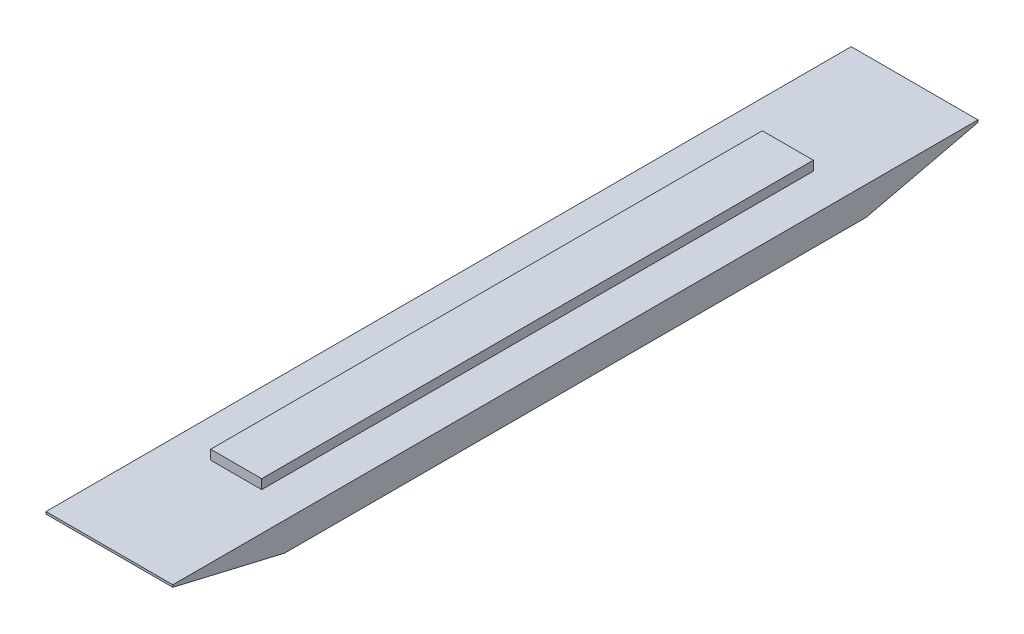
ISO-10303-21;
HEADER;
FILE_DESCRIPTION(('STEP AP214'),'2;1');
FILE_NAME('part.step','',(''),(''),'','','');
FILE_SCHEMA(('AUTOMOTIVE_DESIGN { 1 0 10303 214 1 1 1 1 }'));
ENDSEC;
DATA;
#1=APPLICATION_CONTEXT('core data for automotive mechanical design processes');
#2=APPLICATION_PROTOCOL_DEFINITION('international standard','automotive_design',2000,#1);
#3=PRODUCT_CONTEXT('',#1,'mechanical');
#4=PRODUCT('Part','Part','',(#3));
#5=PRODUCT_RELATED_PRODUCT_CATEGORY('part','',(#4));
#6=PRODUCT_DEFINITION_FORMATION('','',#4);
#7=PRODUCT_DEFINITION_CONTEXT('part definition',#1,'design');
#8=PRODUCT_DEFINITION('design','',#6,#7);
#9=PRODUCT_DEFINITION_SHAPE('','',#8);
#10=(LENGTH_UNIT() NAMED_UNIT(*) SI_UNIT(.MILLI.,.METRE.));
#11=(NAMED_UNIT(*) PLANE_ANGLE_UNIT() SI_UNIT($,.RADIAN.));
#12=(NAMED_UNIT(*) SI_UNIT($,.STERADIAN.) SOLID_ANGLE_UNIT());
#13=UNCERTAINTY_MEASURE_WITH_UNIT(LENGTH_MEASURE(1.E-05),#10,'distance_accuracy_value','');
#14=(GEOMETRIC_REPRESENTATION_CONTEXT(3) GLOBAL_UNCERTAINTY_ASSIGNED_CONTEXT((#13)) GLOBAL_UNIT_ASSIGNED_CONTEXT((#10,
#11,#12)) REPRESENTATION_CONTEXT('',''));
#15=CARTESIAN_POINT('',(0.,0.,0.));
#16=DIRECTION('',(0.,0.,1.));
#17=DIRECTION('',(1.,0.,0.));
#18=AXIS2_PLACEMENT_3D('',#15,#16,#17);
#19=CARTESIAN_POINT('',(-200.,-45.,870.));
#20=DIRECTION('',(0.,1.,0.));
#21=DIRECTION('',(0.,0.,1.));
#22=AXIS2_PLACEMENT_3D('',#19,#20,#21);
#23=PLANE('',#22);
#24=DIRECTION('',(-1.,0.,0.));
#25=VECTOR('',#24,1.);
#26=CARTESIAN_POINT('',(-199.999999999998,-45.,-917.52510595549));
#27=LINE('',#26,#25);
#28=CARTESIAN_POINT('',(200.,-44.9999999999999,-917.525105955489));
#29=VERTEX_POINT('',#28);
#30=CARTESIAN_POINT('',(-200.,-45.,-917.52510595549));
#31=VERTEX_POINT('',#30);
#32=EDGE_CURVE('E790',#29,#31,#27,.T.);
#33=ORIENTED_EDGE('',*,*,#32,.F.);
#34=DIRECTION('',(0.,0.,-1.));
#35=VECTOR('',#34,1.);
#36=CARTESIAN_POINT('',(200.,-45.,870.));
#37=LINE('',#36,#35);
#38=CARTESIAN_POINT('',(200.,-45.,917.52510595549));
#39=VERTEX_POINT('',#38);
#40=EDGE_CURVE('E460',#39,#29,#37,.T.);
#41=ORIENTED_EDGE('',*,*,#40,.F.);
#42=DIRECTION('',(-1.,0.,0.));
#43=VECTOR('',#42,1.);
#44=CARTESIAN_POINT('',(-200.,-45.,917.52510595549));
#45=LINE('',#44,#43);
#46=CARTESIAN_POINT('',(-200.,-45.,917.52510595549));
#47=VERTEX_POINT('',#46);
#48=EDGE_CURVE('E606',#39,#47,#45,.T.);
#49=ORIENTED_EDGE('',*,*,#48,.T.);
#50=DIRECTION('',(0.,0.,-1.));
#51=VECTOR('',#50,1.);
#52=CARTESIAN_POINT('',(-200.,-45.,870.));
#53=LINE('',#52,#51);
#54=EDGE_CURVE('E463',#47,#31,#53,.T.);
#55=ORIENTED_EDGE('',*,*,#54,.T.);
#56=EDGE_LOOP('',(#33,#41,#49,#55));
#57=FACE_BOUND('',#56,.T.);
#58=DIRECTION('',(0.,0.,-1.));
#59=VECTOR('',#58,1.);
#60=CARTESIAN_POINT('',(168.,-45.,870.));
#61=LINE('',#60,#59);
#62=CARTESIAN_POINT('',(168.,-45.,870.));
#63=VERTEX_POINT('',#62);
#64=CARTESIAN_POINT('',(168.,-45.,-870.));
#65=VERTEX_POINT('',#64);
#66=EDGE_CURVE('E647',#63,#65,#61,.T.);
#67=ORIENTED_EDGE('',*,*,#66,.T.);
#68=DIRECTION('',(1.,0.,0.));
#69=VECTOR('',#68,1.);
#70=CARTESIAN_POINT('',(-200.,-45.,-870.));
#71=LINE('',#70,#69);
#72=CARTESIAN_POINT('',(-170.,-45.,-870.));
#73=VERTEX_POINT('',#72);
#74=EDGE_CURVE('E779',#73,#65,#71,.T.);
#75=ORIENTED_EDGE('',*,*,#74,.F.);
#76=DIRECTION('',(0.,0.,-1.));
#77=VECTOR('',#76,1.);
#78=CARTESIAN_POINT('',(-170.,-45.,870.));
#79=LINE('',#78,#77);
#80=CARTESIAN_POINT('',(-170.,-45.,870.));
#81=VERTEX_POINT('',#80);
#82=EDGE_CURVE('E407',#81,#73,#79,.T.);
#83=ORIENTED_EDGE('',*,*,#82,.F.);
#84=DIRECTION('',(1.,0.,0.));
#85=VECTOR('',#84,1.);
#86=CARTESIAN_POINT('',(-200.,-45.,870.));
#87=LINE('',#86,#85);
#88=EDGE_CURVE('E611',#81,#63,#87,.T.);
#89=ORIENTED_EDGE('',*,*,#88,.T.);
#90=EDGE_LOOP('',(#67,#75,#83,#89));
#91=FACE_BOUND('',#90,.T.);
#92=ADVANCED_FACE('F29',(#57,#91),#23,.F.);
#93=DIRECTION('',(-1.,0.,0.));
#94=VECTOR('',#93,1.);
#95=CARTESIAN_POINT('',(239.413147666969,-45.0000000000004,-820.));
#96=LINE('',#95,#94);
#97=CARTESIAN_POINT('',(150.,-45.0000000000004,-820.));
#98=VERTEX_POINT('',#97);
#99=CARTESIAN_POINT('',(88.,-45.0000000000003,-820.));
#100=VERTEX_POINT('',#99);
#101=EDGE_CURVE('E393',#98,#100,#96,.T.);
#102=ORIENTED_EDGE('',*,*,#101,.F.);
#103=DIRECTION('',(0.,0.,-1.));
#104=VECTOR('',#103,1.);
#105=CARTESIAN_POINT('',(150.,-45.,870.));
#106=LINE('',#105,#104);
#107=CARTESIAN_POINT('',(150.,-45.0000000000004,820.));
#108=VERTEX_POINT('',#107);
#109=EDGE_CURVE('E643',#108,#98,#106,.T.);
#110=ORIENTED_EDGE('',*,*,#109,.F.);
#111=DIRECTION('',(-1.,0.,0.));
#112=VECTOR('',#111,1.);
#113=CARTESIAN_POINT('',(239.413147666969,-45.0000000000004,820.));
#114=LINE('',#113,#112);
#115=CARTESIAN_POINT('',(88.,-45.0000000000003,820.));
#116=VERTEX_POINT('',#115);
#117=EDGE_CURVE('E520',#108,#116,#114,.T.);
#118=ORIENTED_EDGE('',*,*,#117,.T.);
#119=DIRECTION('',(0.,0.,-1.));
#120=VECTOR('',#119,1.);
#121=CARTESIAN_POINT('',(88.,-45.,870.));
#122=LINE('',#121,#120);
#123=EDGE_CURVE('E669',#116,#100,#122,.T.);
#124=ORIENTED_EDGE('',*,*,#123,.T.);
#125=EDGE_LOOP('',(#102,#110,#118,#124));
#126=FACE_BOUND('',#125,.T.);
#127=ADVANCED_FACE('F940',(#126),#23,.F.);
#128=CARTESIAN_POINT('',(70.,-45.0000000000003,-820.));
#129=VERTEX_POINT('',#128);
#130=CARTESIAN_POINT('',(8.00000000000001,-45.0000000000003,-820.));
#131=VERTEX_POINT('',#130);
#132=EDGE_CURVE('E1615',#129,#131,#96,.T.);
#133=ORIENTED_EDGE('',*,*,#132,.F.);
#134=DIRECTION('',(0.,0.,-1.));
#135=VECTOR('',#134,1.);
#136=CARTESIAN_POINT('',(70.,-45.,870.));
#137=LINE('',#136,#135);
#138=CARTESIAN_POINT('',(70.,-45.0000000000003,820.));
#139=VERTEX_POINT('',#138);
#140=EDGE_CURVE('E665',#139,#129,#137,.T.);
#141=ORIENTED_EDGE('',*,*,#140,.F.);
#142=CARTESIAN_POINT('',(8.00000000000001,-45.0000000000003,820.));
#143=VERTEX_POINT('',#142);
#144=EDGE_CURVE('E878',#139,#143,#114,.T.);
#145=ORIENTED_EDGE('',*,*,#144,.T.);
#146=DIRECTION('',(0.,0.,-1.));
#147=VECTOR('',#146,1.);
#148=CARTESIAN_POINT('',(8.00000000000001,-45.,870.));
#149=LINE('',#148,#147);
#150=EDGE_CURVE('E693',#143,#131,#149,.T.);
#151=ORIENTED_EDGE('',*,*,#150,.T.);
#152=EDGE_LOOP('',(#133,#141,#145,#151));
#153=FACE_BOUND('',#152,.T.);
#154=ADVANCED_FACE('F882',(#153),#23,.F.);
#155=CARTESIAN_POINT('',(-9.99999999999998,-45.0000000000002,-820.));
#156=VERTEX_POINT('',#155);
#157=CARTESIAN_POINT('',(-72.,-45.0000000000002,-820.));
#158=VERTEX_POINT('',#157);
#159=EDGE_CURVE('E391',#156,#158,#96,.T.);
#160=ORIENTED_EDGE('',*,*,#159,.F.);
#161=DIRECTION('',(0.,0.,-1.));
#162=VECTOR('',#161,1.);
#163=CARTESIAN_POINT('',(-9.99999999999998,-45.,870.));
#164=LINE('',#163,#162);
#165=CARTESIAN_POINT('',(-9.99999999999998,-45.0000000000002,820.));
#166=VERTEX_POINT('',#165);
#167=EDGE_CURVE('E689',#166,#156,#164,.T.);
#168=ORIENTED_EDGE('',*,*,#167,.F.);
#169=CARTESIAN_POINT('',(-72.,-45.0000000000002,820.));
#170=VERTEX_POINT('',#169);
#171=EDGE_CURVE('E518',#166,#170,#114,.T.);
#172=ORIENTED_EDGE('',*,*,#171,.T.);
#173=DIRECTION('',(0.,0.,-1.));
#174=VECTOR('',#173,1.);
#175=CARTESIAN_POINT('',(-72.,-45.,870.));
#176=LINE('',#175,#174);
#177=EDGE_CURVE('E716',#170,#158,#176,.T.);
#178=ORIENTED_EDGE('',*,*,#177,.T.);
#179=EDGE_LOOP('',(#160,#168,#172,#178));
#180=FACE_BOUND('',#179,.T.);
#181=ADVANCED_FACE('F889',(#180),#23,.F.);
#182=CARTESIAN_POINT('',(-90.,-45.0000000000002,-820.));
#183=VERTEX_POINT('',#182);
#184=CARTESIAN_POINT('',(-152.,-45.0000000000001,-820.));
#185=VERTEX_POINT('',#184);
#186=EDGE_CURVE('E380',#183,#185,#96,.T.);
#187=ORIENTED_EDGE('',*,*,#186,.F.);
#188=DIRECTION('',(0.,0.,-1.));
#189=VECTOR('',#188,1.);
#190=CARTESIAN_POINT('',(-90.,-45.,870.));
#191=LINE('',#190,#189);
#192=CARTESIAN_POINT('',(-90.,-45.0000000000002,820.));
#193=VERTEX_POINT('',#192);
#194=EDGE_CURVE('E713',#193,#183,#191,.T.);
#195=ORIENTED_EDGE('',*,*,#194,.F.);
#196=CARTESIAN_POINT('',(-152.,-45.0000000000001,820.));
#197=VERTEX_POINT('',#196);
#198=EDGE_CURVE('E406',#193,#197,#114,.T.);
#199=ORIENTED_EDGE('',*,*,#198,.T.);
#200=DIRECTION('',(0.,0.,-1.));
#201=VECTOR('',#200,1.);
#202=CARTESIAN_POINT('',(-152.,-45.,870.));
#203=LINE('',#202,#201);
#204=EDGE_CURVE('E399',#197,#185,#203,.T.);
#205=ORIENTED_EDGE('',*,*,#204,.T.);
#206=EDGE_LOOP('',(#187,#195,#199,#205));
#207=FACE_BOUND('',#206,.T.);
#208=ADVANCED_FACE('F405',(#207),#23,.F.);
#209=CARTESIAN_POINT('',(-152.,-45.,870.));
#210=DIRECTION('',(1.,0.,0.));
#211=DIRECTION('',(0.,0.,-1.));
#212=AXIS2_PLACEMENT_3D('',#209,#210,#211);
#213=PLANE('',#212);
#214=DIRECTION('',(0.,-1.,0.));
#215=VECTOR('',#214,1.);
#216=CARTESIAN_POINT('',(-152.,-45.0000000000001,-820.));
#217=LINE('',#216,#215);
#218=CARTESIAN_POINT('',(-152.,-10.,-820.));
#219=VERTEX_POINT('',#218);
#220=EDGE_CURVE('E383',#219,#185,#217,.T.);
#221=ORIENTED_EDGE('',*,*,#220,.T.);
#222=ORIENTED_EDGE('',*,*,#204,.F.);
#223=DIRECTION('',(0.,-1.,0.));
#224=VECTOR('',#223,1.);
#225=CARTESIAN_POINT('',(-152.,-45.0000000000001,820.));
#226=LINE('',#225,#224);
#227=CARTESIAN_POINT('',(-152.,-10.,820.));
#228=VERTEX_POINT('',#227);
#229=EDGE_CURVE('E509',#228,#197,#226,.T.);
#230=ORIENTED_EDGE('',*,*,#229,.F.);
#231=DIRECTION('',(0.,0.,-1.));
#232=VECTOR('',#231,1.);
#233=CARTESIAN_POINT('',(-152.,-9.99999999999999,870.));
#234=LINE('',#233,#232);
#235=EDGE_CURVE('E401',#228,#219,#234,.T.);
#236=ORIENTED_EDGE('',*,*,#235,.T.);
#237=EDGE_LOOP('',(#221,#222,#230,#236));
#238=FACE_BOUND('',#237,.T.);
#239=ADVANCED_FACE('F397',(#238),#213,.F.);
#240=CARTESIAN_POINT('',(-152.,-9.99999999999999,870.));
#241=DIRECTION('',(0.,-1.,0.));
#242=DIRECTION('',(0.,0.,-1.));
#243=AXIS2_PLACEMENT_3D('',#240,#241,#242);
#244=PLANE('',#243);
#245=DIRECTION('',(1.,0.,0.));
#246=VECTOR('',#245,1.);
#247=CARTESIAN_POINT('',(-152.,-9.99999999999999,-820.));
#248=LINE('',#247,#246);
#249=CARTESIAN_POINT('',(-141.,-9.99999999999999,-820.));
#250=VERTEX_POINT('',#249);
#251=EDGE_CURVE('E806',#219,#250,#248,.T.);
#252=ORIENTED_EDGE('',*,*,#251,.F.);
#253=ORIENTED_EDGE('',*,*,#235,.F.);
#254=DIRECTION('',(1.,0.,0.));
#255=VECTOR('',#254,1.);
#256=CARTESIAN_POINT('',(-152.,-9.99999999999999,820.));
#257=LINE('',#256,#255);
#258=CARTESIAN_POINT('',(-141.,-9.99999999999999,820.));
#259=VERTEX_POINT('',#258);
#260=EDGE_CURVE('E586',#228,#259,#257,.T.);
#261=ORIENTED_EDGE('',*,*,#260,.T.);
#262=DIRECTION('',(0.,0.,-1.));
#263=VECTOR('',#262,1.);
#264=CARTESIAN_POINT('',(-141.,-9.99999999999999,870.));
#265=LINE('',#264,#263);
#266=EDGE_CURVE('E412',#259,#250,#265,.T.);
#267=ORIENTED_EDGE('',*,*,#266,.T.);
#268=EDGE_LOOP('',(#252,#253,#261,#267));
#269=FACE_BOUND('',#268,.T.);
#270=ADVANCED_FACE('F953',(#269),#244,.F.);
#271=CARTESIAN_POINT('',(-141.,-9.99999999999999,870.));
#272=DIRECTION('',(1.,0.,0.));
#273=DIRECTION('',(0.,0.,-1.));
#274=AXIS2_PLACEMENT_3D('',#271,#272,#273);
#275=PLANE('',#274);
#276=DIRECTION('',(0.,1.,0.));
#277=VECTOR('',#276,1.);
#278=CARTESIAN_POINT('',(-141.,-9.99999999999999,-820.));
#279=LINE('',#278,#277);
#280=CARTESIAN_POINT('',(-141.,5.98860323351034,-820.));
#281=VERTEX_POINT('',#280);
#282=EDGE_CURVE('E808',#250,#281,#279,.T.);
#283=ORIENTED_EDGE('',*,*,#282,.F.);
#284=ORIENTED_EDGE('',*,*,#266,.F.);
#285=DIRECTION('',(0.,1.,0.));
#286=VECTOR('',#285,1.);
#287=CARTESIAN_POINT('',(-141.,-9.99999999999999,820.));
#288=LINE('',#287,#286);
#289=CARTESIAN_POINT('',(-141.,5.98860323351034,820.));
#290=VERTEX_POINT('',#289);
#291=EDGE_CURVE('E583',#259,#290,#288,.T.);
#292=ORIENTED_EDGE('',*,*,#291,.T.);
#293=DIRECTION('',(0.,0.,-1.));
#294=VECTOR('',#293,1.);
#295=CARTESIAN_POINT('',(-141.,5.98860323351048,870.));
#296=LINE('',#295,#294);
#297=EDGE_CURVE('E418',#290,#281,#296,.T.);
#298=ORIENTED_EDGE('',*,*,#297,.T.);
#299=EDGE_LOOP('',(#283,#284,#292,#298));
#300=FACE_BOUND('',#299,.T.);
#301=ADVANCED_FACE('F1326',(#300),#275,.F.);
#302=CARTESIAN_POINT('',(-90.,-45.,870.));
#303=DIRECTION('',(-1.,0.,0.));
#304=DIRECTION('',(0.,0.,1.));
#305=AXIS2_PLACEMENT_3D('',#302,#303,#304);
#306=PLANE('',#305);
#307=DIRECTION('',(0.,-1.,0.));
#308=VECTOR('',#307,1.);
#309=CARTESIAN_POINT('',(-90.,-45.,-820.));
#310=LINE('',#309,#308);
#311=CARTESIAN_POINT('',(-90.,-9.99999999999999,-820.));
#312=VERTEX_POINT('',#311);
#313=EDGE_CURVE('E386',#312,#183,#310,.T.);
#314=ORIENTED_EDGE('',*,*,#313,.F.);
#315=DIRECTION('',(0.,0.,-1.));
#316=VECTOR('',#315,1.);
#317=CARTESIAN_POINT('',(-90.,-9.99999999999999,870.));
#318=LINE('',#317,#316);
#319=CARTESIAN_POINT('',(-90.,-9.99999999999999,820.));
#320=VERTEX_POINT('',#319);
#321=EDGE_CURVE('E692',#320,#312,#318,.T.);
#322=ORIENTED_EDGE('',*,*,#321,.F.);
#323=DIRECTION('',(0.,-1.,0.));
#324=VECTOR('',#323,1.);
#325=CARTESIAN_POINT('',(-90.,-45.,820.));
#326=LINE('',#325,#324);
#327=EDGE_CURVE('E571',#320,#193,#326,.T.);
#328=ORIENTED_EDGE('',*,*,#327,.T.);
#329=ORIENTED_EDGE('',*,*,#194,.T.);
#330=EDGE_LOOP('',(#314,#322,#328,#329));
#331=FACE_BOUND('',#330,.T.);
#332=ADVANCED_FACE('F1313',(#331),#306,.F.);
#333=CARTESIAN_POINT('',(-72.,-45.,870.));
#334=DIRECTION('',(1.,0.,0.));
#335=DIRECTION('',(0.,0.,-1.));
#336=AXIS2_PLACEMENT_3D('',#333,#334,#335);
#337=PLANE('',#336);
#338=DIRECTION('',(0.,1.,0.));
#339=VECTOR('',#338,1.);
#340=CARTESIAN_POINT('',(-72.,-45.,-820.));
#341=LINE('',#340,#339);
#342=CARTESIAN_POINT('',(-72.,-9.99999999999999,-820.));
#343=VERTEX_POINT('',#342);
#344=EDGE_CURVE('E810',#158,#343,#341,.T.);
#345=ORIENTED_EDGE('',*,*,#344,.F.);
#346=ORIENTED_EDGE('',*,*,#177,.F.);
#347=DIRECTION('',(0.,1.,0.));
#348=VECTOR('',#347,1.);
#349=CARTESIAN_POINT('',(-72.,-45.,820.));
#350=LINE('',#349,#348);
#351=CARTESIAN_POINT('',(-72.,-9.99999999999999,820.));
#352=VERTEX_POINT('',#351);
#353=EDGE_CURVE('E580',#170,#352,#350,.T.);
#354=ORIENTED_EDGE('',*,*,#353,.T.);
#355=DIRECTION('',(0.,0.,-1.));
#356=VECTOR('',#355,1.);
#357=CARTESIAN_POINT('',(-72.,-9.99999999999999,870.));
#358=LINE('',#357,#356);
#359=EDGE_CURVE('E719',#352,#343,#358,.T.);
#360=ORIENTED_EDGE('',*,*,#359,.T.);
#361=EDGE_LOOP('',(#345,#346,#354,#360));
#362=FACE_BOUND('',#361,.T.);
#363=ADVANCED_FACE('F893',(#362),#337,.F.);
#364=CARTESIAN_POINT('',(-72.,-9.99999999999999,870.));
#365=DIRECTION('',(0.,-1.,0.));
#366=DIRECTION('',(0.,0.,-1.));
#367=AXIS2_PLACEMENT_3D('',#364,#365,#366);
#368=PLANE('',#367);
#369=DIRECTION('',(1.,0.,0.));
#370=VECTOR('',#369,1.);
#371=CARTESIAN_POINT('',(-72.,-9.99999999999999,-820.));
#372=LINE('',#371,#370);
#373=CARTESIAN_POINT('',(-61.,-9.99999999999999,-820.));
#374=VERTEX_POINT('',#373);
#375=EDGE_CURVE('E812',#343,#374,#372,.T.);
#376=ORIENTED_EDGE('',*,*,#375,.F.);
#377=ORIENTED_EDGE('',*,*,#359,.F.);
#378=DIRECTION('',(1.,0.,0.));
#379=VECTOR('',#378,1.);
#380=CARTESIAN_POINT('',(-72.,-9.99999999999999,820.));
#381=LINE('',#380,#379);
#382=CARTESIAN_POINT('',(-61.,-9.99999999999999,820.));
#383=VERTEX_POINT('',#382);
#384=EDGE_CURVE('E577',#352,#383,#381,.T.);
#385=ORIENTED_EDGE('',*,*,#384,.T.);
#386=DIRECTION('',(0.,0.,-1.));
#387=VECTOR('',#386,1.);
#388=CARTESIAN_POINT('',(-61.,-9.99999999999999,870.));
#389=LINE('',#388,#387);
#390=EDGE_CURVE('E722',#383,#374,#389,.T.);
#391=ORIENTED_EDGE('',*,*,#390,.T.);
#392=EDGE_LOOP('',(#376,#377,#385,#391));
#393=FACE_BOUND('',#392,.T.);
#394=ADVANCED_FACE('F899',(#393),#368,.F.);
#395=CARTESIAN_POINT('',(-61.,-9.99999999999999,870.));
#396=DIRECTION('',(1.,0.,0.));
#397=DIRECTION('',(0.,0.,-1.));
#398=AXIS2_PLACEMENT_3D('',#395,#396,#397);
#399=PLANE('',#398);
#400=DIRECTION('',(0.,1.,0.));
#401=VECTOR('',#400,1.);
#402=CARTESIAN_POINT('',(-61.,-9.99999999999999,-820.));
#403=LINE('',#402,#401);
#404=CARTESIAN_POINT('',(-61.,5.98860323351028,-820.));
#405=VERTEX_POINT('',#404);
#406=EDGE_CURVE('E814',#374,#405,#403,.T.);
#407=ORIENTED_EDGE('',*,*,#406,.F.);
#408=ORIENTED_EDGE('',*,*,#390,.F.);
#409=DIRECTION('',(0.,1.,0.));
#410=VECTOR('',#409,1.);
#411=CARTESIAN_POINT('',(-61.,-9.99999999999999,820.));
#412=LINE('',#411,#410);
#413=CARTESIAN_POINT('',(-61.,5.98860323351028,820.));
#414=VERTEX_POINT('',#413);
#415=EDGE_CURVE('E574',#383,#414,#412,.T.);
#416=ORIENTED_EDGE('',*,*,#415,.T.);
#417=DIRECTION('',(0.,0.,-1.));
#418=VECTOR('',#417,1.);
#419=CARTESIAN_POINT('',(-61.,5.98860323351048,870.));
#420=LINE('',#419,#418);
#421=EDGE_CURVE('E725',#414,#405,#420,.T.);
#422=ORIENTED_EDGE('',*,*,#421,.T.);
#423=EDGE_LOOP('',(#407,#408,#416,#422));
#424=FACE_BOUND('',#423,.T.);
#425=ADVANCED_FACE('F902',(#424),#399,.F.);
#426=CARTESIAN_POINT('',(-101.,-9.99999999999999,870.));
#427=DIRECTION('',(-1.,0.,0.));
#428=DIRECTION('',(0.,0.,1.));
#429=AXIS2_PLACEMENT_3D('',#426,#427,#428);
#430=PLANE('',#429);
#431=DIRECTION('',(0.,-1.,0.));
#432=VECTOR('',#431,1.);
#433=CARTESIAN_POINT('',(-101.,-9.99999999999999,-820.));
#434=LINE('',#433,#432);
#435=CARTESIAN_POINT('',(-101.,5.98860323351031,-820.));
#436=VERTEX_POINT('',#435);
#437=CARTESIAN_POINT('',(-101.,-9.99999999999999,-820.));
#438=VERTEX_POINT('',#437);
#439=EDGE_CURVE('E817',#436,#438,#434,.T.);
#440=ORIENTED_EDGE('',*,*,#439,.F.);
#441=DIRECTION('',(0.,0.,-1.));
#442=VECTOR('',#441,1.);
#443=CARTESIAN_POINT('',(-101.,5.98860323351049,870.));
#444=LINE('',#443,#442);
#445=CARTESIAN_POINT('',(-101.,5.98860323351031,820.));
#446=VERTEX_POINT('',#445);
#447=EDGE_CURVE('E728',#446,#436,#444,.T.);
#448=ORIENTED_EDGE('',*,*,#447,.F.);
#449=DIRECTION('',(0.,-1.,0.));
#450=VECTOR('',#449,1.);
#451=CARTESIAN_POINT('',(-101.,-9.99999999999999,820.));
#452=LINE('',#451,#450);
#453=CARTESIAN_POINT('',(-101.,-9.99999999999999,820.));
#454=VERTEX_POINT('',#453);
#455=EDGE_CURVE('E568',#446,#454,#452,.T.);
#456=ORIENTED_EDGE('',*,*,#455,.T.);
#457=DIRECTION('',(0.,0.,-1.));
#458=VECTOR('',#457,1.);
#459=CARTESIAN_POINT('',(-101.,-9.99999999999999,870.));
#460=LINE('',#459,#458);
#461=EDGE_CURVE('E731',#454,#438,#460,.T.);
#462=ORIENTED_EDGE('',*,*,#461,.T.);
#463=EDGE_LOOP('',(#440,#448,#456,#462));
#464=FACE_BOUND('',#463,.T.);
#465=ADVANCED_FACE('F1318',(#464),#430,.F.);
#466=CARTESIAN_POINT('',(-101.,-9.99999999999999,870.));
#467=DIRECTION('',(0.,-1.,0.));
#468=DIRECTION('',(1.,0.,0.));
#469=AXIS2_PLACEMENT_3D('',#466,#467,#468);
#470=PLANE('',#469);
#471=DIRECTION('',(1.,0.,0.));
#472=VECTOR('',#471,1.);
#473=CARTESIAN_POINT('',(-101.,-9.99999999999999,-820.));
#474=LINE('',#473,#472);
#475=EDGE_CURVE('E819',#438,#312,#474,.T.);
#476=ORIENTED_EDGE('',*,*,#475,.F.);
#477=ORIENTED_EDGE('',*,*,#461,.F.);
#478=DIRECTION('',(1.,0.,0.));
#479=VECTOR('',#478,1.);
#480=CARTESIAN_POINT('',(-101.,-9.99999999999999,820.));
#481=LINE('',#480,#479);
#482=EDGE_CURVE('E565',#454,#320,#481,.T.);
#483=ORIENTED_EDGE('',*,*,#482,.T.);
#484=ORIENTED_EDGE('',*,*,#321,.T.);
#485=EDGE_LOOP('',(#476,#477,#483,#484));
#486=FACE_BOUND('',#485,.T.);
#487=ADVANCED_FACE('F1310',(#486),#470,.F.);
#488=CARTESIAN_POINT('',(-9.99999999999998,-45.,870.));
#489=DIRECTION('',(-1.,0.,0.));
#490=DIRECTION('',(0.,0.,1.));
#491=AXIS2_PLACEMENT_3D('',#488,#489,#490);
#492=PLANE('',#491);
#493=DIRECTION('',(0.,-1.,0.));
#494=VECTOR('',#493,1.);
#495=CARTESIAN_POINT('',(-9.99999999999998,-45.,-820.));
#496=LINE('',#495,#494);
#497=CARTESIAN_POINT('',(-9.99999999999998,-9.99999999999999,-820.));
#498=VERTEX_POINT('',#497);
#499=EDGE_CURVE('E827',#498,#156,#496,.T.);
#500=ORIENTED_EDGE('',*,*,#499,.F.);
#501=DIRECTION('',(0.,0.,-1.));
#502=VECTOR('',#501,1.);
#503=CARTESIAN_POINT('',(-9.99999999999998,-9.99999999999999,870.));
#504=LINE('',#503,#502);
#505=CARTESIAN_POINT('',(-9.99999999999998,-9.99999999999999,820.));
#506=VERTEX_POINT('',#505);
#507=EDGE_CURVE('E668',#506,#498,#504,.T.);
#508=ORIENTED_EDGE('',*,*,#507,.F.);
#509=DIRECTION('',(0.,-1.,0.));
#510=VECTOR('',#509,1.);
#511=CARTESIAN_POINT('',(-9.99999999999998,-45.,820.));
#512=LINE('',#511,#510);
#513=EDGE_CURVE('E553',#506,#166,#512,.T.);
#514=ORIENTED_EDGE('',*,*,#513,.T.);
#515=ORIENTED_EDGE('',*,*,#167,.T.);
#516=EDGE_LOOP('',(#500,#508,#514,#515));
#517=FACE_BOUND('',#516,.T.);
#518=ADVANCED_FACE('F914',(#517),#492,.F.);
#519=CARTESIAN_POINT('',(8.00000000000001,-45.,870.));
#520=DIRECTION('',(1.,0.,0.));
#521=DIRECTION('',(0.,0.,-1.));
#522=AXIS2_PLACEMENT_3D('',#519,#520,#521);
#523=PLANE('',#522);
#524=DIRECTION('',(0.,1.,0.));
#525=VECTOR('',#524,1.);
#526=CARTESIAN_POINT('',(8.00000000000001,-45.,-820.));
#527=LINE('',#526,#525);
#528=CARTESIAN_POINT('',(8.00000000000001,-9.99999999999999,-820.));
#529=VERTEX_POINT('',#528);
#530=EDGE_CURVE('E821',#131,#529,#527,.T.);
#531=ORIENTED_EDGE('',*,*,#530,.F.);
#532=ORIENTED_EDGE('',*,*,#150,.F.);
#533=DIRECTION('',(0.,1.,0.));
#534=VECTOR('',#533,1.);
#535=CARTESIAN_POINT('',(8.00000000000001,-45.,820.));
#536=LINE('',#535,#534);
#537=CARTESIAN_POINT('',(8.00000000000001,-9.99999999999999,820.));
#538=VERTEX_POINT('',#537);
#539=EDGE_CURVE('E562',#143,#538,#536,.T.);
#540=ORIENTED_EDGE('',*,*,#539,.T.);
#541=DIRECTION('',(0.,0.,-1.));
#542=VECTOR('',#541,1.);
#543=CARTESIAN_POINT('',(8.00000000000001,-9.99999999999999,870.));
#544=LINE('',#543,#542);
#545=EDGE_CURVE('E696',#538,#529,#544,.T.);
#546=ORIENTED_EDGE('',*,*,#545,.T.);
#547=EDGE_LOOP('',(#531,#532,#540,#546));
#548=FACE_BOUND('',#547,.T.);
#549=ADVANCED_FACE('F875',(#548),#523,.F.);
#550=CARTESIAN_POINT('',(8.00000000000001,-9.99999999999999,870.));
#551=DIRECTION('',(0.,-1.,0.));
#552=DIRECTION('',(0.,0.,-1.));
#553=AXIS2_PLACEMENT_3D('',#550,#551,#552);
#554=PLANE('',#553);
#555=DIRECTION('',(1.,0.,0.));
#556=VECTOR('',#555,1.);
#557=CARTESIAN_POINT('',(8.00000000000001,-9.99999999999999,-820.));
#558=LINE('',#557,#556);
#559=CARTESIAN_POINT('',(19.,-9.99999999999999,-820.));
#560=VERTEX_POINT('',#559);
#561=EDGE_CURVE('E823',#529,#560,#558,.T.);
#562=ORIENTED_EDGE('',*,*,#561,.F.);
#563=ORIENTED_EDGE('',*,*,#545,.F.);
#564=DIRECTION('',(1.,0.,0.));
#565=VECTOR('',#564,1.);
#566=CARTESIAN_POINT('',(8.00000000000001,-9.99999999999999,820.));
#567=LINE('',#566,#565);
#568=CARTESIAN_POINT('',(19.,-9.99999999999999,820.));
#569=VERTEX_POINT('',#568);
#570=EDGE_CURVE('E559',#538,#569,#567,.T.);
#571=ORIENTED_EDGE('',*,*,#570,.T.);
#572=DIRECTION('',(0.,0.,-1.));
#573=VECTOR('',#572,1.);
#574=CARTESIAN_POINT('',(19.,-9.99999999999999,870.));
#575=LINE('',#574,#573);
#576=EDGE_CURVE('E699',#569,#560,#575,.T.);
#577=ORIENTED_EDGE('',*,*,#576,.T.);
#578=EDGE_LOOP('',(#562,#563,#571,#577));
#579=FACE_BOUND('',#578,.T.);
#580=ADVANCED_FACE('F872',(#579),#554,.F.);
#581=CARTESIAN_POINT('',(19.,-9.99999999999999,870.));
#582=DIRECTION('',(1.,0.,0.));
#583=DIRECTION('',(0.,0.,-1.));
#584=AXIS2_PLACEMENT_3D('',#581,#582,#583);
#585=PLANE('',#584);
#586=DIRECTION('',(0.,1.,0.));
#587=VECTOR('',#586,1.);
#588=CARTESIAN_POINT('',(19.,-9.99999999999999,-820.));
#589=LINE('',#588,#587);
#590=CARTESIAN_POINT('',(19.,5.98860323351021,-820.));
#591=VERTEX_POINT('',#590);
#592=EDGE_CURVE('E825',#560,#591,#589,.T.);
#593=ORIENTED_EDGE('',*,*,#592,.F.);
#594=ORIENTED_EDGE('',*,*,#576,.F.);
#595=DIRECTION('',(0.,1.,0.));
#596=VECTOR('',#595,1.);
#597=CARTESIAN_POINT('',(19.,-9.99999999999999,820.));
#598=LINE('',#597,#596);
#599=CARTESIAN_POINT('',(19.,5.98860323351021,820.));
#600=VERTEX_POINT('',#599);
#601=EDGE_CURVE('E556',#569,#600,#598,.T.);
#602=ORIENTED_EDGE('',*,*,#601,.T.);
#603=DIRECTION('',(0.,0.,-1.));
#604=VECTOR('',#603,1.);
#605=CARTESIAN_POINT('',(19.,5.98860323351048,870.));
#606=LINE('',#605,#604);
#607=EDGE_CURVE('E702',#600,#591,#606,.T.);
#608=ORIENTED_EDGE('',*,*,#607,.T.);
#609=EDGE_LOOP('',(#593,#594,#602,#608));
#610=FACE_BOUND('',#609,.T.);
#611=ADVANCED_FACE('F864',(#610),#585,.F.);
#612=CARTESIAN_POINT('',(-21.,-9.99999999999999,870.));
#613=DIRECTION('',(-1.,0.,0.));
#614=DIRECTION('',(0.,0.,1.));
#615=AXIS2_PLACEMENT_3D('',#612,#613,#614);
#616=PLANE('',#615);
#617=DIRECTION('',(0.,-1.,0.));
#618=VECTOR('',#617,1.);
#619=CARTESIAN_POINT('',(-21.,-9.99999999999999,-820.));
#620=LINE('',#619,#618);
#621=CARTESIAN_POINT('',(-21.,5.98860323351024,-820.));
#622=VERTEX_POINT('',#621);
#623=CARTESIAN_POINT('',(-21.,-9.99999999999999,-820.));
#624=VERTEX_POINT('',#623);
#625=EDGE_CURVE('E44',#622,#624,#620,.T.);
#626=ORIENTED_EDGE('',*,*,#625,.F.);
#627=DIRECTION('',(0.,0.,-1.));
#628=VECTOR('',#627,1.);
#629=CARTESIAN_POINT('',(-21.,5.98860323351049,870.));
#630=LINE('',#629,#628);
#631=CARTESIAN_POINT('',(-21.,5.98860323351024,820.));
#632=VERTEX_POINT('',#631);
#633=EDGE_CURVE('E705',#632,#622,#630,.T.);
#634=ORIENTED_EDGE('',*,*,#633,.F.);
#635=DIRECTION('',(0.,-1.,0.));
#636=VECTOR('',#635,1.);
#637=CARTESIAN_POINT('',(-21.,-9.99999999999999,820.));
#638=LINE('',#637,#636);
#639=CARTESIAN_POINT('',(-21.,-9.99999999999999,820.));
#640=VERTEX_POINT('',#639);
#641=EDGE_CURVE('E550',#632,#640,#638,.T.);
#642=ORIENTED_EDGE('',*,*,#641,.T.);
#643=DIRECTION('',(0.,0.,-1.));
#644=VECTOR('',#643,1.);
#645=CARTESIAN_POINT('',(-21.,-9.99999999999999,870.));
#646=LINE('',#645,#644);
#647=EDGE_CURVE('E708',#640,#624,#646,.T.);
#648=ORIENTED_EDGE('',*,*,#647,.T.);
#649=EDGE_LOOP('',(#626,#634,#642,#648));
#650=FACE_BOUND('',#649,.T.);
#651=ADVANCED_FACE('F907',(#650),#616,.F.);
#652=CARTESIAN_POINT('',(-21.,-9.99999999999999,870.));
#653=DIRECTION('',(0.,-1.,0.));
#654=DIRECTION('',(1.,0.,0.));
#655=AXIS2_PLACEMENT_3D('',#652,#653,#654);
#656=PLANE('',#655);
#657=DIRECTION('',(1.,0.,0.));
#658=VECTOR('',#657,1.);
#659=CARTESIAN_POINT('',(-21.,-9.99999999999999,-820.));
#660=LINE('',#659,#658);
#661=EDGE_CURVE('E830',#624,#498,#660,.T.);
#662=ORIENTED_EDGE('',*,*,#661,.F.);
#663=ORIENTED_EDGE('',*,*,#647,.F.);
#664=DIRECTION('',(1.,0.,0.));
#665=VECTOR('',#664,1.);
#666=CARTESIAN_POINT('',(-21.,-9.99999999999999,820.));
#667=LINE('',#666,#665);
#668=EDGE_CURVE('E547',#640,#506,#667,.T.);
#669=ORIENTED_EDGE('',*,*,#668,.T.);
#670=ORIENTED_EDGE('',*,*,#507,.T.);
#671=EDGE_LOOP('',(#662,#663,#669,#670));
#672=FACE_BOUND('',#671,.T.);
#673=ADVANCED_FACE('F910',(#672),#656,.F.);
#674=CARTESIAN_POINT('',(70.,-45.,870.));
#675=DIRECTION('',(-1.,0.,0.));
#676=DIRECTION('',(0.,0.,1.));
#677=AXIS2_PLACEMENT_3D('',#674,#675,#676);
#678=PLANE('',#677);
#679=DIRECTION('',(0.,-1.,0.));
#680=VECTOR('',#679,1.);
#681=CARTESIAN_POINT('',(70.,-45.,-820.));
#682=LINE('',#681,#680);
#683=CARTESIAN_POINT('',(70.,-9.99999999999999,-820.));
#684=VERTEX_POINT('',#683);
#685=EDGE_CURVE('E838',#684,#129,#682,.T.);
#686=ORIENTED_EDGE('',*,*,#685,.F.);
#687=DIRECTION('',(0.,0.,-1.));
#688=VECTOR('',#687,1.);
#689=CARTESIAN_POINT('',(70.,-9.99999999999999,870.));
#690=LINE('',#689,#688);
#691=CARTESIAN_POINT('',(70.,-9.99999999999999,820.));
#692=VERTEX_POINT('',#691);
#693=EDGE_CURVE('E646',#692,#684,#690,.T.);
#694=ORIENTED_EDGE('',*,*,#693,.F.);
#695=DIRECTION('',(0.,-1.,0.));
#696=VECTOR('',#695,1.);
#697=CARTESIAN_POINT('',(70.,-45.,820.));
#698=LINE('',#697,#696);
#699=EDGE_CURVE('E535',#692,#139,#698,.T.);
#700=ORIENTED_EDGE('',*,*,#699,.T.);
#701=ORIENTED_EDGE('',*,*,#140,.T.);
#702=EDGE_LOOP('',(#686,#694,#700,#701));
#703=FACE_BOUND('',#702,.T.);
#704=ADVANCED_FACE('F1281',(#703),#678,.F.);
#705=CARTESIAN_POINT('',(88.,-45.,870.));
#706=DIRECTION('',(1.,0.,0.));
#707=DIRECTION('',(0.,0.,-1.));
#708=AXIS2_PLACEMENT_3D('',#705,#706,#707);
#709=PLANE('',#708);
#710=DIRECTION('',(0.,1.,0.));
#711=VECTOR('',#710,1.);
#712=CARTESIAN_POINT('',(88.,-45.,-820.));
#713=LINE('',#712,#711);
#714=CARTESIAN_POINT('',(88.,-9.99999999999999,-820.));
#715=VERTEX_POINT('',#714);
#716=EDGE_CURVE('E832',#100,#715,#713,.T.);
#717=ORIENTED_EDGE('',*,*,#716,.F.);
#718=ORIENTED_EDGE('',*,*,#123,.F.);
#719=DIRECTION('',(0.,1.,0.));
#720=VECTOR('',#719,1.);
#721=CARTESIAN_POINT('',(88.,-45.,820.));
#722=LINE('',#721,#720);
#723=CARTESIAN_POINT('',(88.,-9.99999999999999,820.));
#724=VERTEX_POINT('',#723);
#725=EDGE_CURVE('E544',#116,#724,#722,.T.);
#726=ORIENTED_EDGE('',*,*,#725,.T.);
#727=DIRECTION('',(0.,0.,-1.));
#728=VECTOR('',#727,1.);
#729=CARTESIAN_POINT('',(88.,-9.99999999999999,870.));
#730=LINE('',#729,#728);
#731=EDGE_CURVE('E672',#724,#715,#730,.T.);
#732=ORIENTED_EDGE('',*,*,#731,.T.);
#733=EDGE_LOOP('',(#717,#718,#726,#732));
#734=FACE_BOUND('',#733,.T.);
#735=ADVANCED_FACE('F1277',(#734),#709,.F.);
#736=CARTESIAN_POINT('',(88.,-9.99999999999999,870.));
#737=DIRECTION('',(0.,-1.,0.));
#738=DIRECTION('',(0.,0.,-1.));
#739=AXIS2_PLACEMENT_3D('',#736,#737,#738);
#740=PLANE('',#739);
#741=DIRECTION('',(1.,0.,0.));
#742=VECTOR('',#741,1.);
#743=CARTESIAN_POINT('',(88.,-9.99999999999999,-820.));
#744=LINE('',#743,#742);
#745=CARTESIAN_POINT('',(99.,-9.99999999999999,-820.));
#746=VERTEX_POINT('',#745);
#747=EDGE_CURVE('E834',#715,#746,#744,.T.);
#748=ORIENTED_EDGE('',*,*,#747,.F.);
#749=ORIENTED_EDGE('',*,*,#731,.F.);
#750=DIRECTION('',(1.,0.,0.));
#751=VECTOR('',#750,1.);
#752=CARTESIAN_POINT('',(88.,-9.99999999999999,820.));
#753=LINE('',#752,#751);
#754=CARTESIAN_POINT('',(99.,-9.99999999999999,820.));
#755=VERTEX_POINT('',#754);
#756=EDGE_CURVE('E541',#724,#755,#753,.T.);
#757=ORIENTED_EDGE('',*,*,#756,.T.);
#758=DIRECTION('',(0.,0.,-1.));
#759=VECTOR('',#758,1.);
#760=CARTESIAN_POINT('',(99.,-9.99999999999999,870.));
#761=LINE('',#760,#759);
#762=EDGE_CURVE('E675',#755,#746,#761,.T.);
#763=ORIENTED_EDGE('',*,*,#762,.T.);
#764=EDGE_LOOP('',(#748,#749,#757,#763));
#765=FACE_BOUND('',#764,.T.);
#766=ADVANCED_FACE('F1280',(#765),#740,.F.);
#767=CARTESIAN_POINT('',(99.,-9.99999999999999,870.));
#768=DIRECTION('',(1.,0.,0.));
#769=DIRECTION('',(0.,0.,-1.));
#770=AXIS2_PLACEMENT_3D('',#767,#768,#769);
#771=PLANE('',#770);
#772=DIRECTION('',(0.,1.,0.));
#773=VECTOR('',#772,1.);
#774=CARTESIAN_POINT('',(99.,-9.99999999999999,-820.));
#775=LINE('',#774,#773);
#776=CARTESIAN_POINT('',(99.,5.98860323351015,-820.));
#777=VERTEX_POINT('',#776);
#778=EDGE_CURVE('E836',#746,#777,#775,.T.);
#779=ORIENTED_EDGE('',*,*,#778,.F.);
#780=ORIENTED_EDGE('',*,*,#762,.F.);
#781=DIRECTION('',(0.,1.,0.));
#782=VECTOR('',#781,1.);
#783=CARTESIAN_POINT('',(99.,-9.99999999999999,820.));
#784=LINE('',#783,#782);
#785=CARTESIAN_POINT('',(99.,5.98860323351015,820.));
#786=VERTEX_POINT('',#785);
#787=EDGE_CURVE('E538',#755,#786,#784,.T.);
#788=ORIENTED_EDGE('',*,*,#787,.T.);
#789=DIRECTION('',(0.,0.,-1.));
#790=VECTOR('',#789,1.);
#791=CARTESIAN_POINT('',(99.,5.98860323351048,870.));
#792=LINE('',#791,#790);
#793=EDGE_CURVE('E678',#786,#777,#792,.T.);
#794=ORIENTED_EDGE('',*,*,#793,.T.);
#795=EDGE_LOOP('',(#779,#780,#788,#794));
#796=FACE_BOUND('',#795,.T.);
#797=ADVANCED_FACE('F923',(#796),#771,.F.);
#798=CARTESIAN_POINT('',(59.,-9.99999999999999,870.));
#799=DIRECTION('',(-1.,0.,0.));
#800=DIRECTION('',(0.,0.,1.));
#801=AXIS2_PLACEMENT_3D('',#798,#799,#800);
#802=PLANE('',#801);
#803=DIRECTION('',(0.,-1.,0.));
#804=VECTOR('',#803,1.);
#805=CARTESIAN_POINT('',(59.,-9.99999999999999,-820.));
#806=LINE('',#805,#804);
#807=CARTESIAN_POINT('',(59.,5.98860323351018,-820.));
#808=VERTEX_POINT('',#807);
#809=CARTESIAN_POINT('',(59.,-9.99999999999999,-820.));
#810=VERTEX_POINT('',#809);
#811=EDGE_CURVE('E52',#808,#810,#806,.T.);
#812=ORIENTED_EDGE('',*,*,#811,.F.);
#813=DIRECTION('',(0.,0.,-1.));
#814=VECTOR('',#813,1.);
#815=CARTESIAN_POINT('',(59.,5.98860323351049,870.));
#816=LINE('',#815,#814);
#817=CARTESIAN_POINT('',(59.,5.98860323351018,820.));
#818=VERTEX_POINT('',#817);
#819=EDGE_CURVE('E681',#818,#808,#816,.T.);
#820=ORIENTED_EDGE('',*,*,#819,.F.);
#821=DIRECTION('',(0.,-1.,0.));
#822=VECTOR('',#821,1.);
#823=CARTESIAN_POINT('',(59.,-9.99999999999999,820.));
#824=LINE('',#823,#822);
#825=CARTESIAN_POINT('',(59.,-9.99999999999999,820.));
#826=VERTEX_POINT('',#825);
#827=EDGE_CURVE('E532',#818,#826,#824,.T.);
#828=ORIENTED_EDGE('',*,*,#827,.T.);
#829=DIRECTION('',(0.,0.,-1.));
#830=VECTOR('',#829,1.);
#831=CARTESIAN_POINT('',(59.,-9.99999999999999,870.));
#832=LINE('',#831,#830);
#833=EDGE_CURVE('E684',#826,#810,#832,.T.);
#834=ORIENTED_EDGE('',*,*,#833,.T.);
#835=EDGE_LOOP('',(#812,#820,#828,#834));
#836=FACE_BOUND('',#835,.T.);
#837=ADVANCED_FACE('F1288',(#836),#802,.F.);
#838=CARTESIAN_POINT('',(59.,-9.99999999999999,870.));
#839=DIRECTION('',(0.,-1.,0.));
#840=DIRECTION('',(1.,0.,0.));
#841=AXIS2_PLACEMENT_3D('',#838,#839,#840);
#842=PLANE('',#841);
#843=DIRECTION('',(1.,0.,0.));
#844=VECTOR('',#843,1.);
#845=CARTESIAN_POINT('',(59.,-9.99999999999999,-820.));
#846=LINE('',#845,#844);
#847=EDGE_CURVE('E841',#810,#684,#846,.T.);
#848=ORIENTED_EDGE('',*,*,#847,.F.);
#849=ORIENTED_EDGE('',*,*,#833,.F.);
#850=DIRECTION('',(1.,0.,0.));
#851=VECTOR('',#850,1.);
#852=CARTESIAN_POINT('',(59.,-9.99999999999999,820.));
#853=LINE('',#852,#851);
#854=EDGE_CURVE('E529',#826,#692,#853,.T.);
#855=ORIENTED_EDGE('',*,*,#854,.T.);
#856=ORIENTED_EDGE('',*,*,#693,.T.);
#857=EDGE_LOOP('',(#848,#849,#855,#856));
#858=FACE_BOUND('',#857,.T.);
#859=ADVANCED_FACE('F1275',(#858),#842,.F.);
#860=CARTESIAN_POINT('',(150.,-45.,870.));
#861=DIRECTION('',(-1.,0.,0.));
#862=DIRECTION('',(0.,0.,1.));
#863=AXIS2_PLACEMENT_3D('',#860,#861,#862);
#864=PLANE('',#863);
#865=DIRECTION('',(0.,-1.,0.));
#866=VECTOR('',#865,1.);
#867=CARTESIAN_POINT('',(150.,-45.,-820.));
#868=LINE('',#867,#866);
#869=CARTESIAN_POINT('',(150.,-9.99999999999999,-820.));
#870=VERTEX_POINT('',#869);
#871=EDGE_CURVE('E843',#870,#98,#868,.T.);
#872=ORIENTED_EDGE('',*,*,#871,.F.);
#873=DIRECTION('',(0.,0.,-1.));
#874=VECTOR('',#873,1.);
#875=CARTESIAN_POINT('',(150.,-9.99999999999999,870.));
#876=LINE('',#875,#874);
#877=CARTESIAN_POINT('',(150.,-9.99999999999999,820.));
#878=VERTEX_POINT('',#877);
#879=EDGE_CURVE('E642',#878,#870,#876,.T.);
#880=ORIENTED_EDGE('',*,*,#879,.F.);
#881=DIRECTION('',(0.,-1.,0.));
#882=VECTOR('',#881,1.);
#883=CARTESIAN_POINT('',(150.,-45.,820.));
#884=LINE('',#883,#882);
#885=EDGE_CURVE('E526',#878,#108,#884,.T.);
#886=ORIENTED_EDGE('',*,*,#885,.T.);
#887=ORIENTED_EDGE('',*,*,#109,.T.);
#888=EDGE_LOOP('',(#872,#880,#886,#887));
#889=FACE_BOUND('',#888,.T.);
#890=ADVANCED_FACE('F1268',(#889),#864,.F.);
#891=CARTESIAN_POINT('',(139.,-9.99999999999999,870.));
#892=DIRECTION('',(-1.,0.,0.));
#893=DIRECTION('',(0.,0.,1.));
#894=AXIS2_PLACEMENT_3D('',#891,#892,#893);
#895=PLANE('',#894);
#896=DIRECTION('',(0.,-1.,0.));
#897=VECTOR('',#896,1.);
#898=CARTESIAN_POINT('',(139.,-9.99999999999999,-820.));
#899=LINE('',#898,#897);
#900=CARTESIAN_POINT('',(139.,5.98860323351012,-820.));
#901=VERTEX_POINT('',#900);
#902=CARTESIAN_POINT('',(139.,-9.99999999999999,-820.));
#903=VERTEX_POINT('',#902);
#904=EDGE_CURVE('E845',#901,#903,#899,.T.);
#905=ORIENTED_EDGE('',*,*,#904,.F.);
#906=DIRECTION('',(0.,0.,-1.));
#907=VECTOR('',#906,1.);
#908=CARTESIAN_POINT('',(139.,5.98860323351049,870.));
#909=LINE('',#908,#907);
#910=CARTESIAN_POINT('',(139.,5.98860323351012,820.));
#911=VERTEX_POINT('',#910);
#912=EDGE_CURVE('E657',#911,#901,#909,.T.);
#913=ORIENTED_EDGE('',*,*,#912,.F.);
#914=DIRECTION('',(0.,-1.,0.));
#915=VECTOR('',#914,1.);
#916=CARTESIAN_POINT('',(139.,-9.99999999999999,820.));
#917=LINE('',#916,#915);
#918=CARTESIAN_POINT('',(139.,-9.99999999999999,820.));
#919=VERTEX_POINT('',#918);
#920=EDGE_CURVE('E523',#911,#919,#917,.T.);
#921=ORIENTED_EDGE('',*,*,#920,.T.);
#922=DIRECTION('',(0.,0.,-1.));
#923=VECTOR('',#922,1.);
#924=CARTESIAN_POINT('',(139.,-9.99999999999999,870.));
#925=LINE('',#924,#923);
#926=EDGE_CURVE('E660',#919,#903,#925,.T.);
#927=ORIENTED_EDGE('',*,*,#926,.T.);
#928=EDGE_LOOP('',(#905,#913,#921,#927));
#929=FACE_BOUND('',#928,.T.);
#930=ADVANCED_FACE('F1265',(#929),#895,.F.);
#931=CARTESIAN_POINT('',(139.,-9.99999999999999,870.));
#932=DIRECTION('',(0.,-1.,0.));
#933=DIRECTION('',(1.,0.,0.));
#934=AXIS2_PLACEMENT_3D('',#931,#932,#933);
#935=PLANE('',#934);
#936=DIRECTION('',(1.,0.,0.));
#937=VECTOR('',#936,1.);
#938=CARTESIAN_POINT('',(139.,-9.99999999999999,-820.));
#939=LINE('',#938,#937);
#940=EDGE_CURVE('E11',#903,#870,#939,.T.);
#941=ORIENTED_EDGE('',*,*,#940,.F.);
#942=ORIENTED_EDGE('',*,*,#926,.F.);
#943=DIRECTION('',(1.,0.,0.));
#944=VECTOR('',#943,1.);
#945=CARTESIAN_POINT('',(139.,-9.99999999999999,820.));
#946=LINE('',#945,#944);
#947=EDGE_CURVE('E478',#919,#878,#946,.T.);
#948=ORIENTED_EDGE('',*,*,#947,.T.);
#949=ORIENTED_EDGE('',*,*,#879,.T.);
#950=EDGE_LOOP('',(#941,#942,#948,#949));
#951=FACE_BOUND('',#950,.T.);
#952=ADVANCED_FACE('F1261',(#951),#935,.F.);
#953=CARTESIAN_POINT('',(-3567.00223136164,-76.46377933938,-783.80404376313));
#954=DIRECTION('',(0.,-0.973417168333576,-0.229039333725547));
#955=DIRECTION('',(0.,0.229039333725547,-0.973417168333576));
#956=AXIS2_PLACEMENT_3D('',#953,#954,#955);
#957=PLANE('',#956);
#958=DIRECTION('',(1.,0.,0.));
#959=VECTOR('',#958,1.);
#960=CARTESIAN_POINT('',(-3567.00223136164,-39.711789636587,-940.));
#961=LINE('',#960,#959);
#962=CARTESIAN_POINT('',(-192.,-39.7117896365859,-940.));
#963=VERTEX_POINT('',#962);
#964=CARTESIAN_POINT('',(192.,-39.7117896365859,-940.));
#965=VERTEX_POINT('',#964);
#966=EDGE_CURVE('E485',#963,#965,#961,.T.);
#967=ORIENTED_EDGE('',*,*,#966,.T.);
#968=DIRECTION('',(0.,0.229039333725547,-0.973417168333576));
#969=VECTOR('',#968,1.);
#970=CARTESIAN_POINT('',(192.,-76.4637793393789,-783.804043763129));
#971=LINE('',#970,#969);
#972=CARTESIAN_POINT('',(192.,37.9352691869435,-1270.));
#973=VERTEX_POINT('',#972);
#974=EDGE_CURVE('E37',#965,#973,#971,.T.);
#975=ORIENTED_EDGE('',*,*,#974,.T.);
#976=DIRECTION('',(-1.,0.,0.));
#977=VECTOR('',#976,1.);
#978=CARTESIAN_POINT('',(-200.,37.9352691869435,-1270.));
#979=LINE('',#978,#977);
#980=CARTESIAN_POINT('',(200.,37.9352691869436,-1270.));
#981=VERTEX_POINT('',#980);
#982=EDGE_CURVE('E482',#981,#973,#979,.T.);
#983=ORIENTED_EDGE('',*,*,#982,.F.);
#984=DIRECTION('',(0.,-0.229039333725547,0.973417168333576));
#985=VECTOR('',#984,1.);
#986=CARTESIAN_POINT('',(200.,-438.808876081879,756.162617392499));
#987=LINE('',#986,#985);
#988=EDGE_CURVE('E792',#981,#29,#987,.T.);
#989=ORIENTED_EDGE('',*,*,#988,.T.);
#990=ORIENTED_EDGE('',*,*,#32,.T.);
#991=DIRECTION('',(0.,0.229039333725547,-0.973417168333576));
#992=VECTOR('',#991,1.);
#993=CARTESIAN_POINT('',(-200.,-438.80887608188,756.162617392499));
#994=LINE('',#993,#992);
#995=CARTESIAN_POINT('',(-200.,37.9352691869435,-1270.));
#996=VERTEX_POINT('',#995);
#997=EDGE_CURVE('E785',#31,#996,#994,.T.);
#998=ORIENTED_EDGE('',*,*,#997,.T.);
#999=CARTESIAN_POINT('',(-192.,37.9352691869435,-1270.));
#1000=VERTEX_POINT('',#999);
#1001=EDGE_CURVE('E481',#1000,#996,#979,.T.);
#1002=ORIENTED_EDGE('',*,*,#1001,.F.);
#1003=DIRECTION('',(0.,-0.229039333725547,0.973417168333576));
#1004=VECTOR('',#1003,1.);
#1005=CARTESIAN_POINT('',(-192.,-76.463779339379,-783.804043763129));
#1006=LINE('',#1005,#1004);
#1007=EDGE_CURVE('E488',#1000,#963,#1006,.T.);
#1008=ORIENTED_EDGE('',*,*,#1007,.T.);
#1009=EDGE_LOOP('',(#967,#975,#983,#989,#990,#998,#1002,#1008));
#1010=FACE_BOUND('',#1009,.T.);
#1011=ADVANCED_FACE('F492',(#1010),#957,.T.);
#1012=CARTESIAN_POINT('',(-200.,45.,870.));
#1013=DIRECTION('',(1.,0.,0.));
#1014=DIRECTION('',(0.,1.,0.));
#1015=AXIS2_PLACEMENT_3D('',#1012,#1013,#1014);
#1016=PLANE('',#1015);
#1017=ORIENTED_EDGE('',*,*,#997,.F.);
#1018=ORIENTED_EDGE('',*,*,#54,.F.);
#1019=DIRECTION('',(0.,0.229039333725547,0.973417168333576));
#1020=VECTOR('',#1019,1.);
#1021=CARTESIAN_POINT('',(-200.,-50.8744498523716,892.558694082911));
#1022=LINE('',#1021,#1020);
#1023=CARTESIAN_POINT('',(-200.,37.9352691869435,1270.));
#1024=VERTEX_POINT('',#1023);
#1025=EDGE_CURVE('E608',#47,#1024,#1022,.T.);
#1026=ORIENTED_EDGE('',*,*,#1025,.T.);
#1027=DIRECTION('',(0.,-1.,0.));
#1028=VECTOR('',#1027,1.);
#1029=CARTESIAN_POINT('',(-200.,45.,1270.));
#1030=LINE('',#1029,#1028);
#1031=CARTESIAN_POINT('',(-200.,45.,1270.));
#1032=VERTEX_POINT('',#1031);
#1033=EDGE_CURVE('E616',#1032,#1024,#1030,.T.);
#1034=ORIENTED_EDGE('',*,*,#1033,.F.);
#1035=DIRECTION('',(0.,0.,-1.));
#1036=VECTOR('',#1035,1.);
#1037=CARTESIAN_POINT('',(-200.,45.,870.));
#1038=LINE('',#1037,#1036);
#1039=CARTESIAN_POINT('',(-200.,45.,-1270.));
#1040=VERTEX_POINT('',#1039);
#1041=EDGE_CURVE('E443',#1032,#1040,#1038,.T.);
#1042=ORIENTED_EDGE('',*,*,#1041,.T.);
#1043=DIRECTION('',(0.,-1.,0.));
#1044=VECTOR('',#1043,1.);
#1045=CARTESIAN_POINT('',(-200.,45.,-1270.));
#1046=LINE('',#1045,#1044);
#1047=EDGE_CURVE('E513',#1040,#996,#1046,.T.);
#1048=ORIENTED_EDGE('',*,*,#1047,.T.);
#1049=EDGE_LOOP('',(#1017,#1018,#1026,#1034,#1042,#1048));
#1050=FACE_BOUND('',#1049,.T.);
#1051=ADVANCED_FACE('F31',(#1050),#1016,.F.);
#1052=CARTESIAN_POINT('',(200.,45.,870.));
#1053=DIRECTION('',(-1.,0.,0.));
#1054=DIRECTION('',(0.,-1.,0.));
#1055=AXIS2_PLACEMENT_3D('',#1052,#1053,#1054);
#1056=PLANE('',#1055);
#1057=ORIENTED_EDGE('',*,*,#988,.F.);
#1058=DIRECTION('',(0.,1.,0.));
#1059=VECTOR('',#1058,1.);
#1060=CARTESIAN_POINT('',(200.,45.,-1270.));
#1061=LINE('',#1060,#1059);
#1062=CARTESIAN_POINT('',(200.,45.,-1270.));
#1063=VERTEX_POINT('',#1062);
#1064=EDGE_CURVE('E503',#981,#1063,#1061,.T.);
#1065=ORIENTED_EDGE('',*,*,#1064,.T.);
#1066=DIRECTION('',(0.,0.,-1.));
#1067=VECTOR('',#1066,1.);
#1068=CARTESIAN_POINT('',(200.,45.,870.));
#1069=LINE('',#1068,#1067);
#1070=CARTESIAN_POINT('',(200.,45.,1270.));
#1071=VERTEX_POINT('',#1070);
#1072=EDGE_CURVE('E457',#1071,#1063,#1069,.T.);
#1073=ORIENTED_EDGE('',*,*,#1072,.F.);
#1074=DIRECTION('',(0.,1.,0.));
#1075=VECTOR('',#1074,1.);
#1076=CARTESIAN_POINT('',(200.,45.,1270.));
#1077=LINE('',#1076,#1075);
#1078=CARTESIAN_POINT('',(200.,37.9352691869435,1270.));
#1079=VERTEX_POINT('',#1078);
#1080=EDGE_CURVE('E619',#1079,#1071,#1077,.T.);
#1081=ORIENTED_EDGE('',*,*,#1080,.F.);
#1082=DIRECTION('',(0.,-0.229039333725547,-0.973417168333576));
#1083=VECTOR('',#1082,1.);
#1084=CARTESIAN_POINT('',(200.,-50.8744498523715,892.558694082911));
#1085=LINE('',#1084,#1083);
#1086=EDGE_CURVE('E603',#1079,#39,#1085,.T.);
#1087=ORIENTED_EDGE('',*,*,#1086,.T.);
#1088=ORIENTED_EDGE('',*,*,#40,.T.);
#1089=EDGE_LOOP('',(#1057,#1065,#1073,#1081,#1087,#1088));
#1090=FACE_BOUND('',#1089,.T.);
#1091=ADVANCED_FACE('F1263',(#1090),#1056,.F.);
#1092=CARTESIAN_POINT('',(-200.,-45.,-1270.));
#1093=DIRECTION('',(0.,0.,-1.));
#1094=DIRECTION('',(1.,0.,0.));
#1095=AXIS2_PLACEMENT_3D('',#1092,#1093,#1094);
#1096=PLANE('',#1095);
#1097=ORIENTED_EDGE('',*,*,#1064,.F.);
#1098=ORIENTED_EDGE('',*,*,#982,.T.);
#1099=DIRECTION('',(-1.,0.,0.));
#1100=VECTOR('',#1099,1.);
#1101=CARTESIAN_POINT('',(192.,37.9352691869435,-1270.));
#1102=LINE('',#1101,#1100);
#1103=EDGE_CURVE('E501',#973,#1000,#1102,.T.);
#1104=ORIENTED_EDGE('',*,*,#1103,.T.);
#1105=ORIENTED_EDGE('',*,*,#1001,.T.);
#1106=ORIENTED_EDGE('',*,*,#1047,.F.);
#1107=DIRECTION('',(-1.,0.,0.));
#1108=VECTOR('',#1107,1.);
#1109=CARTESIAN_POINT('',(-200.,45.,-1270.));
#1110=LINE('',#1109,#1108);
#1111=EDGE_CURVE('E506',#1063,#1040,#1110,.T.);
#1112=ORIENTED_EDGE('',*,*,#1111,.F.);
#1113=EDGE_LOOP('',(#1097,#1098,#1104,#1105,#1106,#1112));
#1114=FACE_BOUND('',#1113,.T.);
#1115=ADVANCED_FACE('F500',(#1114),#1096,.T.);
#1116=CARTESIAN_POINT('',(-200.,45.,870.));
#1117=DIRECTION('',(0.,0.,1.));
#1118=DIRECTION('',(1.,0.,0.));
#1119=AXIS2_PLACEMENT_3D('',#1116,#1117,#1118);
#1120=PLANE('',#1119);
#1121=DIRECTION('',(0.,-1.,0.));
#1122=VECTOR('',#1121,1.);
#1123=CARTESIAN_POINT('',(-80.5,75.,870.));
#1124=LINE('',#1123,#1122);
#1125=CARTESIAN_POINT('',(-80.5,75.,870.));
#1126=VERTEX_POINT('',#1125);
#1127=CARTESIAN_POINT('',(-80.5,45.,870.));
#1128=VERTEX_POINT('',#1127);
#1129=EDGE_CURVE('E441',#1126,#1128,#1124,.T.);
#1130=ORIENTED_EDGE('',*,*,#1129,.T.);
#1131=DIRECTION('',(-1.,0.,0.));
#1132=VECTOR('',#1131,1.);
#1133=CARTESIAN_POINT('',(-200.,45.,870.));
#1134=LINE('',#1133,#1132);
#1135=CARTESIAN_POINT('',(80.5,45.,870.));
#1136=VERTEX_POINT('',#1135);
#1137=EDGE_CURVE('E613',#1136,#1128,#1134,.T.);
#1138=ORIENTED_EDGE('',*,*,#1137,.F.);
#1139=DIRECTION('',(0.,1.,0.));
#1140=VECTOR('',#1139,1.);
#1141=CARTESIAN_POINT('',(80.5,75.,870.));
#1142=LINE('',#1141,#1140);
#1143=CARTESIAN_POINT('',(80.5,75.,870.));
#1144=VERTEX_POINT('',#1143);
#1145=EDGE_CURVE('E437',#1136,#1144,#1142,.T.);
#1146=ORIENTED_EDGE('',*,*,#1145,.T.);
#1147=DIRECTION('',(-1.,0.,0.));
#1148=VECTOR('',#1147,1.);
#1149=CARTESIAN_POINT('',(-80.5,75.,870.));
#1150=LINE('',#1149,#1148);
#1151=EDGE_CURVE('E439',#1144,#1126,#1150,.T.);
#1152=ORIENTED_EDGE('',*,*,#1151,.T.);
#1153=EDGE_LOOP('',(#1130,#1138,#1146,#1152));
#1154=FACE_BOUND('',#1153,.T.);
#1155=ADVANCED_FACE('F1082',(#1154),#1120,.T.);
#1156=CARTESIAN_POINT('',(80.5,75.,870.));
#1157=DIRECTION('',(-1.,0.,0.));
#1158=DIRECTION('',(0.,0.,1.));
#1159=AXIS2_PLACEMENT_3D('',#1156,#1157,#1158);
#1160=PLANE('',#1159);
#1161=DIRECTION('',(0.,1.,0.));
#1162=VECTOR('',#1161,1.);
#1163=CARTESIAN_POINT('',(80.5,75.,-870.));
#1164=LINE('',#1163,#1162);
#1165=CARTESIAN_POINT('',(80.5,45.,-870.));
#1166=VERTEX_POINT('',#1165);
#1167=CARTESIAN_POINT('',(80.5,75.,-870.));
#1168=VERTEX_POINT('',#1167);
#1169=EDGE_CURVE('E410',#1166,#1168,#1164,.T.);
#1170=ORIENTED_EDGE('',*,*,#1169,.T.);
#1171=DIRECTION('',(0.,0.,-1.));
#1172=VECTOR('',#1171,1.);
#1173=CARTESIAN_POINT('',(80.5,75.,870.));
#1174=LINE('',#1173,#1172);
#1175=EDGE_CURVE('E451',#1144,#1168,#1174,.T.);
#1176=ORIENTED_EDGE('',*,*,#1175,.F.);
#1177=ORIENTED_EDGE('',*,*,#1145,.F.);
#1178=DIRECTION('',(0.,0.,-1.));
#1179=VECTOR('',#1178,1.);
#1180=CARTESIAN_POINT('',(80.5,45.,870.));
#1181=LINE('',#1180,#1179);
#1182=EDGE_CURVE('E454',#1136,#1166,#1181,.T.);
#1183=ORIENTED_EDGE('',*,*,#1182,.T.);
#1184=EDGE_LOOP('',(#1170,#1176,#1177,#1183));
#1185=FACE_BOUND('',#1184,.T.);
#1186=ADVANCED_FACE('F1087',(#1185),#1160,.F.);
#1187=CARTESIAN_POINT('',(-80.5,75.,870.));
#1188=DIRECTION('',(0.,-1.,0.));
#1189=DIRECTION('',(0.,0.,-1.));
#1190=AXIS2_PLACEMENT_3D('',#1187,#1188,#1189);
#1191=PLANE('',#1190);
#1192=DIRECTION('',(-1.,0.,0.));
#1193=VECTOR('',#1192,1.);
#1194=CARTESIAN_POINT('',(-80.5,75.,-870.));
#1195=LINE('',#1194,#1193);
#1196=CARTESIAN_POINT('',(-80.5,75.,-870.));
#1197=VERTEX_POINT('',#1196);
#1198=EDGE_CURVE('E432',#1168,#1197,#1195,.T.);
#1199=ORIENTED_EDGE('',*,*,#1198,.T.);
#1200=DIRECTION('',(0.,0.,-1.));
#1201=VECTOR('',#1200,1.);
#1202=CARTESIAN_POINT('',(-80.5,75.,870.));
#1203=LINE('',#1202,#1201);
#1204=EDGE_CURVE('E448',#1126,#1197,#1203,.T.);
#1205=ORIENTED_EDGE('',*,*,#1204,.F.);
#1206=ORIENTED_EDGE('',*,*,#1151,.F.);
#1207=ORIENTED_EDGE('',*,*,#1175,.T.);
#1208=EDGE_LOOP('',(#1199,#1205,#1206,#1207));
#1209=FACE_BOUND('',#1208,.T.);
#1210=ADVANCED_FACE('F1097',(#1209),#1191,.F.);
#1211=CARTESIAN_POINT('',(-80.5,75.,870.));
#1212=DIRECTION('',(1.,0.,0.));
#1213=DIRECTION('',(0.,0.,-1.));
#1214=AXIS2_PLACEMENT_3D('',#1211,#1212,#1213);
#1215=PLANE('',#1214);
#1216=DIRECTION('',(0.,-1.,0.));
#1217=VECTOR('',#1216,1.);
#1218=CARTESIAN_POINT('',(-80.5,75.,-870.));
#1219=LINE('',#1218,#1217);
#1220=CARTESIAN_POINT('',(-80.5,45.,-870.));
#1221=VERTEX_POINT('',#1220);
#1222=EDGE_CURVE('E434',#1197,#1221,#1219,.T.);
#1223=ORIENTED_EDGE('',*,*,#1222,.T.);
#1224=DIRECTION('',(0.,0.,-1.));
#1225=VECTOR('',#1224,1.);
#1226=CARTESIAN_POINT('',(-80.5,45.,870.));
#1227=LINE('',#1226,#1225);
#1228=EDGE_CURVE('E445',#1128,#1221,#1227,.T.);
#1229=ORIENTED_EDGE('',*,*,#1228,.F.);
#1230=ORIENTED_EDGE('',*,*,#1129,.F.);
#1231=ORIENTED_EDGE('',*,*,#1204,.T.);
#1232=EDGE_LOOP('',(#1223,#1229,#1230,#1231));
#1233=FACE_BOUND('',#1232,.T.);
#1234=ADVANCED_FACE('F1101',(#1233),#1215,.F.);
#1235=CARTESIAN_POINT('',(-200.,45.,870.));
#1236=DIRECTION('',(0.,-1.,0.));
#1237=DIRECTION('',(0.,0.,-1.));
#1238=AXIS2_PLACEMENT_3D('',#1235,#1236,#1237);
#1239=PLANE('',#1238);
#1240=DIRECTION('',(-1.,0.,0.));
#1241=VECTOR('',#1240,1.);
#1242=CARTESIAN_POINT('',(-200.,45.,-870.));
#1243=LINE('',#1242,#1241);
#1244=EDGE_CURVE('E782',#1166,#1221,#1243,.T.);
#1245=ORIENTED_EDGE('',*,*,#1244,.F.);
#1246=ORIENTED_EDGE('',*,*,#1182,.F.);
#1247=ORIENTED_EDGE('',*,*,#1137,.T.);
#1248=ORIENTED_EDGE('',*,*,#1228,.T.);
#1249=EDGE_LOOP('',(#1245,#1246,#1247,#1248));
#1250=FACE_BOUND('',#1249,.T.);
#1251=ORIENTED_EDGE('',*,*,#1072,.T.);
#1252=ORIENTED_EDGE('',*,*,#1111,.T.);
#1253=ORIENTED_EDGE('',*,*,#1041,.F.);
#1254=DIRECTION('',(-1.,0.,0.));
#1255=VECTOR('',#1254,1.);
#1256=CARTESIAN_POINT('',(-200.,45.,1270.));
#1257=LINE('',#1256,#1255);
#1258=EDGE_CURVE('E621',#1071,#1032,#1257,.T.);
#1259=ORIENTED_EDGE('',*,*,#1258,.F.);
#1260=EDGE_LOOP('',(#1251,#1252,#1253,#1259));
#1261=FACE_BOUND('',#1260,.T.);
#1262=ADVANCED_FACE('F1115',(#1250,#1261),#1239,.F.);
#1263=CARTESIAN_POINT('',(-200.,45.,-870.));
#1264=DIRECTION('',(0.,0.,1.));
#1265=DIRECTION('',(1.,0.,0.));
#1266=AXIS2_PLACEMENT_3D('',#1263,#1264,#1265);
#1267=PLANE('',#1266);
#1268=ORIENTED_EDGE('',*,*,#1169,.F.);
#1269=ORIENTED_EDGE('',*,*,#1244,.T.);
#1270=ORIENTED_EDGE('',*,*,#1222,.F.);
#1271=ORIENTED_EDGE('',*,*,#1198,.F.);
#1272=EDGE_LOOP('',(#1268,#1269,#1270,#1271));
#1273=FACE_BOUND('',#1272,.T.);
#1274=ADVANCED_FACE('F935',(#1273),#1267,.F.);
#1275=CARTESIAN_POINT('',(-170.,-45.,870.));
#1276=DIRECTION('',(-1.,0.,0.));
#1277=DIRECTION('',(0.,0.,1.));
#1278=AXIS2_PLACEMENT_3D('',#1275,#1276,#1277);
#1279=PLANE('',#1278);
#1280=DIRECTION('',(0.,1.,0.));
#1281=VECTOR('',#1280,1.);
#1282=CARTESIAN_POINT('',(-170.,-45.,-870.));
#1283=LINE('',#1282,#1281);
#1284=CARTESIAN_POINT('',(-170.,-9.99999999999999,-870.));
#1285=VERTEX_POINT('',#1284);
#1286=EDGE_CURVE('E715',#73,#1285,#1283,.T.);
#1287=ORIENTED_EDGE('',*,*,#1286,.T.);
#1288=DIRECTION('',(0.,0.,-1.));
#1289=VECTOR('',#1288,1.);
#1290=CARTESIAN_POINT('',(-170.,-9.99999999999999,870.));
#1291=LINE('',#1290,#1289);
#1292=CARTESIAN_POINT('',(-170.,-9.99999999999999,870.));
#1293=VERTEX_POINT('',#1292);
#1294=EDGE_CURVE('E427',#1293,#1285,#1291,.T.);
#1295=ORIENTED_EDGE('',*,*,#1294,.F.);
#1296=DIRECTION('',(0.,1.,0.));
#1297=VECTOR('',#1296,1.);
#1298=CARTESIAN_POINT('',(-170.,-45.,870.));
#1299=LINE('',#1298,#1297);
#1300=EDGE_CURVE('E746',#81,#1293,#1299,.T.);
#1301=ORIENTED_EDGE('',*,*,#1300,.F.);
#1302=ORIENTED_EDGE('',*,*,#82,.T.);
#1303=EDGE_LOOP('',(#1287,#1295,#1301,#1302));
#1304=FACE_BOUND('',#1303,.T.);
#1305=ADVANCED_FACE('F926',(#1304),#1279,.F.);
#1306=CARTESIAN_POINT('',(-181.,5.98860323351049,870.));
#1307=DIRECTION('',(0.,1.,0.));
#1308=DIRECTION('',(-1.,0.,0.));
#1309=AXIS2_PLACEMENT_3D('',#1306,#1307,#1308);
#1310=PLANE('',#1309);
#1311=DIRECTION('',(1.,0.,0.));
#1312=VECTOR('',#1311,1.);
#1313=CARTESIAN_POINT('',(-181.,5.98860323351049,-870.));
#1314=LINE('',#1313,#1312);
#1315=CARTESIAN_POINT('',(-181.,5.98860323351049,-870.));
#1316=VERTEX_POINT('',#1315);
#1317=CARTESIAN_POINT('',(179.,5.98860323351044,-870.));
#1318=VERTEX_POINT('',#1317);
#1319=EDGE_CURVE('E744',#1316,#1318,#1314,.T.);
#1320=ORIENTED_EDGE('',*,*,#1319,.T.);
#1321=DIRECTION('',(0.,0.,-1.));
#1322=VECTOR('',#1321,1.);
#1323=CARTESIAN_POINT('',(179.,5.98860323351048,870.));
#1324=LINE('',#1323,#1322);
#1325=CARTESIAN_POINT('',(179.,5.98860323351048,870.));
#1326=VERTEX_POINT('',#1325);
#1327=EDGE_CURVE('E654',#1326,#1318,#1324,.T.);
#1328=ORIENTED_EDGE('',*,*,#1327,.F.);
#1329=DIRECTION('',(1.,0.,0.));
#1330=VECTOR('',#1329,1.);
#1331=CARTESIAN_POINT('',(-181.,5.98860323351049,870.));
#1332=LINE('',#1331,#1330);
#1333=CARTESIAN_POINT('',(-181.,5.98860323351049,870.));
#1334=VERTEX_POINT('',#1333);
#1335=EDGE_CURVE('E430',#1334,#1326,#1332,.T.);
#1336=ORIENTED_EDGE('',*,*,#1335,.F.);
#1337=DIRECTION('',(0.,0.,-1.));
#1338=VECTOR('',#1337,1.);
#1339=CARTESIAN_POINT('',(-181.,5.98860323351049,870.));
#1340=LINE('',#1339,#1338);
#1341=EDGE_CURVE('E421',#1334,#1316,#1340,.T.);
#1342=ORIENTED_EDGE('',*,*,#1341,.T.);
#1343=EDGE_LOOP('',(#1320,#1328,#1336,#1342));
#1344=FACE_BOUND('',#1343,.T.);
#1345=ORIENTED_EDGE('',*,*,#912,.T.);
#1346=DIRECTION('',(-1.,0.,0.));
#1347=VECTOR('',#1346,1.);
#1348=CARTESIAN_POINT('',(239.413147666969,5.98860323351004,-820.));
#1349=LINE('',#1348,#1347);
#1350=EDGE_CURVE('E402',#901,#777,#1349,.T.);
#1351=ORIENTED_EDGE('',*,*,#1350,.T.);
#1352=ORIENTED_EDGE('',*,*,#793,.F.);
#1353=DIRECTION('',(-1.,0.,0.));
#1354=VECTOR('',#1353,1.);
#1355=CARTESIAN_POINT('',(239.413147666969,5.98860323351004,820.));
#1356=LINE('',#1355,#1354);
#1357=EDGE_CURVE('E519',#911,#786,#1356,.T.);
#1358=ORIENTED_EDGE('',*,*,#1357,.F.);
#1359=EDGE_LOOP('',(#1345,#1351,#1352,#1358));
#1360=FACE_BOUND('',#1359,.T.);
#1361=ORIENTED_EDGE('',*,*,#819,.T.);
#1362=EDGE_CURVE('E853',#808,#591,#1349,.T.);
#1363=ORIENTED_EDGE('',*,*,#1362,.T.);
#1364=ORIENTED_EDGE('',*,*,#607,.F.);
#1365=EDGE_CURVE('E868',#818,#600,#1356,.T.);
#1366=ORIENTED_EDGE('',*,*,#1365,.F.);
#1367=EDGE_LOOP('',(#1361,#1363,#1364,#1366));
#1368=FACE_BOUND('',#1367,.T.);
#1369=ORIENTED_EDGE('',*,*,#633,.T.);
#1370=EDGE_CURVE('E849',#622,#405,#1349,.T.);
#1371=ORIENTED_EDGE('',*,*,#1370,.T.);
#1372=ORIENTED_EDGE('',*,*,#421,.F.);
#1373=EDGE_CURVE('E522',#632,#414,#1356,.T.);
#1374=ORIENTED_EDGE('',*,*,#1373,.F.);
#1375=EDGE_LOOP('',(#1369,#1371,#1372,#1374));
#1376=FACE_BOUND('',#1375,.T.);
#1377=ORIENTED_EDGE('',*,*,#447,.T.);
#1378=EDGE_CURVE('E847',#436,#281,#1349,.T.);
#1379=ORIENTED_EDGE('',*,*,#1378,.T.);
#1380=ORIENTED_EDGE('',*,*,#297,.F.);
#1381=EDGE_CURVE('E511',#446,#290,#1356,.T.);
#1382=ORIENTED_EDGE('',*,*,#1381,.F.);
#1383=EDGE_LOOP('',(#1377,#1379,#1380,#1382));
#1384=FACE_BOUND('',#1383,.T.);
#1385=ADVANCED_FACE('F761',(#1344,#1360,#1368,#1376,#1384),#1310,.F.);
#1386=CARTESIAN_POINT('',(-181.,-9.99999999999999,870.));
#1387=DIRECTION('',(-1.,0.,0.));
#1388=DIRECTION('',(0.,0.,1.));
#1389=AXIS2_PLACEMENT_3D('',#1386,#1387,#1388);
#1390=PLANE('',#1389);
#1391=DIRECTION('',(0.,1.,0.));
#1392=VECTOR('',#1391,1.);
#1393=CARTESIAN_POINT('',(-181.,-9.99999999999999,-870.));
#1394=LINE('',#1393,#1392);
#1395=CARTESIAN_POINT('',(-181.,-9.99999999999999,-870.));
#1396=VERTEX_POINT('',#1395);
#1397=EDGE_CURVE('E741',#1396,#1316,#1394,.T.);
#1398=ORIENTED_EDGE('',*,*,#1397,.T.);
#1399=ORIENTED_EDGE('',*,*,#1341,.F.);
#1400=DIRECTION('',(0.,1.,0.));
#1401=VECTOR('',#1400,1.);
#1402=CARTESIAN_POINT('',(-181.,-9.99999999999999,870.));
#1403=LINE('',#1402,#1401);
#1404=CARTESIAN_POINT('',(-181.,-9.99999999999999,870.));
#1405=VERTEX_POINT('',#1404);
#1406=EDGE_CURVE('E752',#1405,#1334,#1403,.T.);
#1407=ORIENTED_EDGE('',*,*,#1406,.F.);
#1408=DIRECTION('',(0.,0.,-1.));
#1409=VECTOR('',#1408,1.);
#1410=CARTESIAN_POINT('',(-181.,-9.99999999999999,870.));
#1411=LINE('',#1410,#1409);
#1412=EDGE_CURVE('E424',#1405,#1396,#1411,.T.);
#1413=ORIENTED_EDGE('',*,*,#1412,.T.);
#1414=EDGE_LOOP('',(#1398,#1399,#1407,#1413));
#1415=FACE_BOUND('',#1414,.T.);
#1416=ADVANCED_FACE('F925',(#1415),#1390,.F.);
#1417=CARTESIAN_POINT('',(-181.,-9.99999999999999,870.));
#1418=DIRECTION('',(0.,-1.,0.));
#1419=DIRECTION('',(1.,0.,0.));
#1420=AXIS2_PLACEMENT_3D('',#1417,#1418,#1419);
#1421=PLANE('',#1420);
#1422=DIRECTION('',(-1.,0.,0.));
#1423=VECTOR('',#1422,1.);
#1424=CARTESIAN_POINT('',(-181.,-9.99999999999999,-870.));
#1425=LINE('',#1424,#1423);
#1426=EDGE_CURVE('E738',#1285,#1396,#1425,.T.);
#1427=ORIENTED_EDGE('',*,*,#1426,.T.);
#1428=ORIENTED_EDGE('',*,*,#1412,.F.);
#1429=DIRECTION('',(-1.,0.,0.));
#1430=VECTOR('',#1429,1.);
#1431=CARTESIAN_POINT('',(-181.,-9.99999999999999,870.));
#1432=LINE('',#1431,#1430);
#1433=EDGE_CURVE('E749',#1293,#1405,#1432,.T.);
#1434=ORIENTED_EDGE('',*,*,#1433,.F.);
#1435=ORIENTED_EDGE('',*,*,#1294,.T.);
#1436=EDGE_LOOP('',(#1427,#1428,#1434,#1435));
#1437=FACE_BOUND('',#1436,.T.);
#1438=ADVANCED_FACE('F932',(#1437),#1421,.F.);
#1439=CARTESIAN_POINT('',(168.,-45.,870.));
#1440=DIRECTION('',(1.,0.,0.));
#1441=DIRECTION('',(0.,0.,-1.));
#1442=AXIS2_PLACEMENT_3D('',#1439,#1440,#1441);
#1443=PLANE('',#1442);
#1444=DIRECTION('',(0.,-1.,0.));
#1445=VECTOR('',#1444,1.);
#1446=CARTESIAN_POINT('',(168.,-45.,-870.));
#1447=LINE('',#1446,#1445);
#1448=CARTESIAN_POINT('',(168.,-9.99999999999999,-870.));
#1449=VERTEX_POINT('',#1448);
#1450=EDGE_CURVE('E630',#1449,#65,#1447,.T.);
#1451=ORIENTED_EDGE('',*,*,#1450,.T.);
#1452=ORIENTED_EDGE('',*,*,#66,.F.);
#1453=DIRECTION('',(0.,-1.,0.));
#1454=VECTOR('',#1453,1.);
#1455=CARTESIAN_POINT('',(168.,-45.,870.));
#1456=LINE('',#1455,#1454);
#1457=CARTESIAN_POINT('',(168.,-9.99999999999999,870.));
#1458=VERTEX_POINT('',#1457);
#1459=EDGE_CURVE('E639',#1458,#63,#1456,.T.);
#1460=ORIENTED_EDGE('',*,*,#1459,.F.);
#1461=DIRECTION('',(0.,0.,-1.));
#1462=VECTOR('',#1461,1.);
#1463=CARTESIAN_POINT('',(168.,-9.99999999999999,870.));
#1464=LINE('',#1463,#1462);
#1465=EDGE_CURVE('E649',#1458,#1449,#1464,.T.);
#1466=ORIENTED_EDGE('',*,*,#1465,.T.);
#1467=EDGE_LOOP('',(#1451,#1452,#1460,#1466));
#1468=FACE_BOUND('',#1467,.T.);
#1469=ADVANCED_FACE('F773',(#1468),#1443,.F.);
#1470=CARTESIAN_POINT('',(168.,-9.99999999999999,870.));
#1471=DIRECTION('',(0.,-1.,0.));
#1472=DIRECTION('',(0.,0.,-1.));
#1473=AXIS2_PLACEMENT_3D('',#1470,#1471,#1472);
#1474=PLANE('',#1473);
#1475=DIRECTION('',(-1.,0.,0.));
#1476=VECTOR('',#1475,1.);
#1477=CARTESIAN_POINT('',(168.,-9.99999999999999,-870.));
#1478=LINE('',#1477,#1476);
#1479=CARTESIAN_POINT('',(179.,-9.99999999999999,-870.));
#1480=VERTEX_POINT('',#1479);
#1481=EDGE_CURVE('E627',#1480,#1449,#1478,.T.);
#1482=ORIENTED_EDGE('',*,*,#1481,.T.);
#1483=ORIENTED_EDGE('',*,*,#1465,.F.);
#1484=DIRECTION('',(-1.,0.,0.));
#1485=VECTOR('',#1484,1.);
#1486=CARTESIAN_POINT('',(168.,-9.99999999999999,870.));
#1487=LINE('',#1486,#1485);
#1488=CARTESIAN_POINT('',(179.,-9.99999999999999,870.));
#1489=VERTEX_POINT('',#1488);
#1490=EDGE_CURVE('E636',#1489,#1458,#1487,.T.);
#1491=ORIENTED_EDGE('',*,*,#1490,.F.);
#1492=DIRECTION('',(0.,0.,-1.));
#1493=VECTOR('',#1492,1.);
#1494=CARTESIAN_POINT('',(179.,-9.99999999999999,870.));
#1495=LINE('',#1494,#1493);
#1496=EDGE_CURVE('E651',#1489,#1480,#1495,.T.);
#1497=ORIENTED_EDGE('',*,*,#1496,.T.);
#1498=EDGE_LOOP('',(#1482,#1483,#1491,#1497));
#1499=FACE_BOUND('',#1498,.T.);
#1500=ADVANCED_FACE('F768',(#1499),#1474,.F.);
#1501=CARTESIAN_POINT('',(179.,-9.99999999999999,870.));
#1502=DIRECTION('',(1.,0.,0.));
#1503=DIRECTION('',(0.,0.,-1.));
#1504=AXIS2_PLACEMENT_3D('',#1501,#1502,#1503);
#1505=PLANE('',#1504);
#1506=DIRECTION('',(0.,-1.,0.));
#1507=VECTOR('',#1506,1.);
#1508=CARTESIAN_POINT('',(179.,-9.99999999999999,-870.));
#1509=LINE('',#1508,#1507);
#1510=EDGE_CURVE('E624',#1318,#1480,#1509,.T.);
#1511=ORIENTED_EDGE('',*,*,#1510,.T.);
#1512=ORIENTED_EDGE('',*,*,#1496,.F.);
#1513=DIRECTION('',(0.,-1.,0.));
#1514=VECTOR('',#1513,1.);
#1515=CARTESIAN_POINT('',(179.,-9.99999999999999,870.));
#1516=LINE('',#1515,#1514);
#1517=EDGE_CURVE('E633',#1326,#1489,#1516,.T.);
#1518=ORIENTED_EDGE('',*,*,#1517,.F.);
#1519=ORIENTED_EDGE('',*,*,#1327,.T.);
#1520=EDGE_LOOP('',(#1511,#1512,#1518,#1519));
#1521=FACE_BOUND('',#1520,.T.);
#1522=ADVANCED_FACE('F765',(#1521),#1505,.F.);
#1523=CARTESIAN_POINT('',(-200.,-45.,870.));
#1524=DIRECTION('',(0.,0.,1.));
#1525=DIRECTION('',(1.,0.,0.));
#1526=AXIS2_PLACEMENT_3D('',#1523,#1524,#1525);
#1527=PLANE('',#1526);
#1528=ORIENTED_EDGE('',*,*,#1459,.T.);
#1529=ORIENTED_EDGE('',*,*,#88,.F.);
#1530=ORIENTED_EDGE('',*,*,#1300,.T.);
#1531=ORIENTED_EDGE('',*,*,#1433,.T.);
#1532=ORIENTED_EDGE('',*,*,#1406,.T.);
#1533=ORIENTED_EDGE('',*,*,#1335,.T.);
#1534=ORIENTED_EDGE('',*,*,#1517,.T.);
#1535=ORIENTED_EDGE('',*,*,#1490,.T.);
#1536=EDGE_LOOP('',(#1528,#1529,#1530,#1531,#1532,#1533,#1534,#1535));
#1537=FACE_BOUND('',#1536,.T.);
#1538=ADVANCED_FACE('F757',(#1537),#1527,.F.);
#1539=CARTESIAN_POINT('',(-200.,-45.,1270.));
#1540=DIRECTION('',(0.,0.,1.));
#1541=DIRECTION('',(1.,0.,0.));
#1542=AXIS2_PLACEMENT_3D('',#1539,#1540,#1541);
#1543=PLANE('',#1542);
#1544=DIRECTION('',(-1.,0.,0.));
#1545=VECTOR('',#1544,1.);
#1546=CARTESIAN_POINT('',(-200.,37.9352691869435,1270.));
#1547=LINE('',#1546,#1545);
#1548=CARTESIAN_POINT('',(192.,37.9352691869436,1270.));
#1549=VERTEX_POINT('',#1548);
#1550=EDGE_CURVE('E467',#1079,#1549,#1547,.T.);
#1551=ORIENTED_EDGE('',*,*,#1550,.F.);
#1552=ORIENTED_EDGE('',*,*,#1080,.T.);
#1553=ORIENTED_EDGE('',*,*,#1258,.T.);
#1554=ORIENTED_EDGE('',*,*,#1033,.T.);
#1555=CARTESIAN_POINT('',(-192.,37.9352691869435,1270.));
#1556=VERTEX_POINT('',#1555);
#1557=EDGE_CURVE('E466',#1556,#1024,#1547,.T.);
#1558=ORIENTED_EDGE('',*,*,#1557,.F.);
#1559=DIRECTION('',(-1.,0.,0.));
#1560=VECTOR('',#1559,1.);
#1561=CARTESIAN_POINT('',(192.,37.9352691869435,1270.));
#1562=LINE('',#1561,#1560);
#1563=EDGE_CURVE('E589',#1549,#1556,#1562,.T.);
#1564=ORIENTED_EDGE('',*,*,#1563,.F.);
#1565=EDGE_LOOP('',(#1551,#1552,#1553,#1554,#1558,#1564));
#1566=FACE_BOUND('',#1565,.T.);
#1567=ADVANCED_FACE('F1016',(#1566),#1543,.T.);
#1568=CARTESIAN_POINT('',(-3074.83367699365,-76.4637793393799,783.80404376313));
#1569=DIRECTION('',(0.,0.973417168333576,-0.229039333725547));
#1570=DIRECTION('',(0.,0.229039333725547,0.973417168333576));
#1571=AXIS2_PLACEMENT_3D('',#1568,#1569,#1570);
#1572=PLANE('',#1571);
#1573=ORIENTED_EDGE('',*,*,#1550,.T.);
#1574=DIRECTION('',(0.,-0.229039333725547,-0.973417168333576));
#1575=VECTOR('',#1574,1.);
#1576=CARTESIAN_POINT('',(192.,-76.4637793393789,783.804043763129));
#1577=LINE('',#1576,#1575);
#1578=CARTESIAN_POINT('',(192.,-39.7117896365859,940.));
#1579=VERTEX_POINT('',#1578);
#1580=EDGE_CURVE('E475',#1549,#1579,#1577,.T.);
#1581=ORIENTED_EDGE('',*,*,#1580,.T.);
#1582=DIRECTION('',(1.,0.,0.));
#1583=VECTOR('',#1582,1.);
#1584=CARTESIAN_POINT('',(-3074.83367699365,-39.7117896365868,940.));
#1585=LINE('',#1584,#1583);
#1586=CARTESIAN_POINT('',(-192.,-39.7117896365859,940.));
#1587=VERTEX_POINT('',#1586);
#1588=EDGE_CURVE('E470',#1587,#1579,#1585,.T.);
#1589=ORIENTED_EDGE('',*,*,#1588,.F.);
#1590=DIRECTION('',(0.,0.229039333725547,0.973417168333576));
#1591=VECTOR('',#1590,1.);
#1592=CARTESIAN_POINT('',(-192.,-76.463779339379,783.804043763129));
#1593=LINE('',#1592,#1591);
#1594=EDGE_CURVE('E472',#1587,#1556,#1593,.T.);
#1595=ORIENTED_EDGE('',*,*,#1594,.T.);
#1596=ORIENTED_EDGE('',*,*,#1557,.T.);
#1597=ORIENTED_EDGE('',*,*,#1025,.F.);
#1598=ORIENTED_EDGE('',*,*,#48,.F.);
#1599=ORIENTED_EDGE('',*,*,#1086,.F.);
#1600=EDGE_LOOP('',(#1573,#1581,#1589,#1595,#1596,#1597,#1598,#1599));
#1601=FACE_BOUND('',#1600,.T.);
#1602=ADVANCED_FACE('F1059',(#1601),#1572,.F.);
#1603=CARTESIAN_POINT('',(192.,-45.,940.));
#1604=DIRECTION('',(1.,0.,0.));
#1605=DIRECTION('',(0.,0.,-1.));
#1606=AXIS2_PLACEMENT_3D('',#1603,#1604,#1605);
#1607=PLANE('',#1606);
#1608=DIRECTION('',(0.,0.,1.));
#1609=VECTOR('',#1608,1.);
#1610=CARTESIAN_POINT('',(192.,37.9352691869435,940.));
#1611=LINE('',#1610,#1609);
#1612=CARTESIAN_POINT('',(192.,37.9352691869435,940.));
#1613=VERTEX_POINT('',#1612);
#1614=EDGE_CURVE('E600',#1613,#1549,#1611,.T.);
#1615=ORIENTED_EDGE('',*,*,#1614,.F.);
#1616=DIRECTION('',(0.,1.,0.));
#1617=VECTOR('',#1616,1.);
#1618=CARTESIAN_POINT('',(192.,-45.,940.));
#1619=LINE('',#1618,#1617);
#1620=EDGE_CURVE('E592',#1579,#1613,#1619,.T.);
#1621=ORIENTED_EDGE('',*,*,#1620,.F.);
#1622=ORIENTED_EDGE('',*,*,#1580,.F.);
#1623=EDGE_LOOP('',(#1615,#1621,#1622));
#1624=FACE_BOUND('',#1623,.T.);
#1625=ADVANCED_FACE('F1049',(#1624),#1607,.F.);
#1626=CARTESIAN_POINT('',(-192.,-45.0000000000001,940.));
#1627=DIRECTION('',(-1.,0.,0.));
#1628=DIRECTION('',(0.,0.,1.));
#1629=AXIS2_PLACEMENT_3D('',#1626,#1627,#1628);
#1630=PLANE('',#1629);
#1631=DIRECTION('',(0.,-1.,0.));
#1632=VECTOR('',#1631,1.);
#1633=CARTESIAN_POINT('',(-192.,-45.0000000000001,940.));
#1634=LINE('',#1633,#1632);
#1635=CARTESIAN_POINT('',(-192.,37.9352691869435,940.));
#1636=VERTEX_POINT('',#1635);
#1637=EDGE_CURVE('E597',#1636,#1587,#1634,.T.);
#1638=ORIENTED_EDGE('',*,*,#1637,.F.);
#1639=DIRECTION('',(0.,0.,1.));
#1640=VECTOR('',#1639,1.);
#1641=CARTESIAN_POINT('',(-192.,37.9352691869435,940.));
#1642=LINE('',#1641,#1640);
#1643=EDGE_CURVE('E601',#1636,#1556,#1642,.T.);
#1644=ORIENTED_EDGE('',*,*,#1643,.T.);
#1645=ORIENTED_EDGE('',*,*,#1594,.F.);
#1646=EDGE_LOOP('',(#1638,#1644,#1645));
#1647=FACE_BOUND('',#1646,.T.);
#1648=ADVANCED_FACE('F1039',(#1647),#1630,.F.);
#1649=CARTESIAN_POINT('',(192.,37.9352691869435,940.));
#1650=DIRECTION('',(0.,0.,1.));
#1651=DIRECTION('',(1.,0.,0.));
#1652=AXIS2_PLACEMENT_3D('',#1649,#1650,#1651);
#1653=PLANE('',#1652);
#1654=ORIENTED_EDGE('',*,*,#1588,.T.);
#1655=ORIENTED_EDGE('',*,*,#1620,.T.);
#1656=DIRECTION('',(-1.,0.,0.));
#1657=VECTOR('',#1656,1.);
#1658=CARTESIAN_POINT('',(192.,37.9352691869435,940.));
#1659=LINE('',#1658,#1657);
#1660=EDGE_CURVE('E594',#1613,#1636,#1659,.T.);
#1661=ORIENTED_EDGE('',*,*,#1660,.T.);
#1662=ORIENTED_EDGE('',*,*,#1637,.T.);
#1663=EDGE_LOOP('',(#1654,#1655,#1661,#1662));
#1664=FACE_BOUND('',#1663,.T.);
#1665=ADVANCED_FACE('F1028',(#1664),#1653,.T.);
#1666=CARTESIAN_POINT('',(192.,37.9352691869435,940.));
#1667=DIRECTION('',(0.,1.,0.));
#1668=DIRECTION('',(0.,0.,1.));
#1669=AXIS2_PLACEMENT_3D('',#1666,#1667,#1668);
#1670=PLANE('',#1669);
#1671=ORIENTED_EDGE('',*,*,#1563,.T.);
#1672=ORIENTED_EDGE('',*,*,#1643,.F.);
#1673=ORIENTED_EDGE('',*,*,#1660,.F.);
#1674=ORIENTED_EDGE('',*,*,#1614,.T.);
#1675=EDGE_LOOP('',(#1671,#1672,#1673,#1674));
#1676=FACE_BOUND('',#1675,.T.);
#1677=ADVANCED_FACE('F1006',(#1676),#1670,.F.);
#1678=CARTESIAN_POINT('',(239.413147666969,-45.0000000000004,820.));
#1679=DIRECTION('',(0.,0.,-1.));
#1680=DIRECTION('',(-1.,0.,0.));
#1681=AXIS2_PLACEMENT_3D('',#1678,#1679,#1680);
#1682=PLANE('',#1681);
#1683=ORIENTED_EDGE('',*,*,#229,.T.);
#1684=ORIENTED_EDGE('',*,*,#198,.F.);
#1685=ORIENTED_EDGE('',*,*,#327,.F.);
#1686=ORIENTED_EDGE('',*,*,#482,.F.);
#1687=ORIENTED_EDGE('',*,*,#455,.F.);
#1688=ORIENTED_EDGE('',*,*,#1381,.T.);
#1689=ORIENTED_EDGE('',*,*,#291,.F.);
#1690=ORIENTED_EDGE('',*,*,#260,.F.);
#1691=EDGE_LOOP('',(#1683,#1684,#1685,#1686,#1687,#1688,#1689,#1690));
#1692=FACE_BOUND('',#1691,.T.);
#1693=ADVANCED_FACE('F982',(#1692),#1682,.F.);
#1694=ORIENTED_EDGE('',*,*,#117,.F.);
#1695=ORIENTED_EDGE('',*,*,#885,.F.);
#1696=ORIENTED_EDGE('',*,*,#947,.F.);
#1697=ORIENTED_EDGE('',*,*,#920,.F.);
#1698=ORIENTED_EDGE('',*,*,#1357,.T.);
#1699=ORIENTED_EDGE('',*,*,#787,.F.);
#1700=ORIENTED_EDGE('',*,*,#756,.F.);
#1701=ORIENTED_EDGE('',*,*,#725,.F.);
#1702=EDGE_LOOP('',(#1694,#1695,#1696,#1697,#1698,#1699,#1700,#1701));
#1703=FACE_BOUND('',#1702,.T.);
#1704=ADVANCED_FACE('F918',(#1703),#1682,.F.);
#1705=ORIENTED_EDGE('',*,*,#144,.F.);
#1706=ORIENTED_EDGE('',*,*,#699,.F.);
#1707=ORIENTED_EDGE('',*,*,#854,.F.);
#1708=ORIENTED_EDGE('',*,*,#827,.F.);
#1709=ORIENTED_EDGE('',*,*,#1365,.T.);
#1710=ORIENTED_EDGE('',*,*,#601,.F.);
#1711=ORIENTED_EDGE('',*,*,#570,.F.);
#1712=ORIENTED_EDGE('',*,*,#539,.F.);
#1713=EDGE_LOOP('',(#1705,#1706,#1707,#1708,#1709,#1710,#1711,#1712));
#1714=FACE_BOUND('',#1713,.T.);
#1715=ADVANCED_FACE('F867',(#1714),#1682,.F.);
#1716=ORIENTED_EDGE('',*,*,#171,.F.);
#1717=ORIENTED_EDGE('',*,*,#513,.F.);
#1718=ORIENTED_EDGE('',*,*,#668,.F.);
#1719=ORIENTED_EDGE('',*,*,#641,.F.);
#1720=ORIENTED_EDGE('',*,*,#1373,.T.);
#1721=ORIENTED_EDGE('',*,*,#415,.F.);
#1722=ORIENTED_EDGE('',*,*,#384,.F.);
#1723=ORIENTED_EDGE('',*,*,#353,.F.);
#1724=EDGE_LOOP('',(#1716,#1717,#1718,#1719,#1720,#1721,#1722,#1723));
#1725=FACE_BOUND('',#1724,.T.);
#1726=ADVANCED_FACE('F915',(#1725),#1682,.F.);
#1727=CARTESIAN_POINT('',(-200.,-45.,-870.));
#1728=DIRECTION('',(0.,0.,-1.));
#1729=DIRECTION('',(1.,0.,0.));
#1730=AXIS2_PLACEMENT_3D('',#1727,#1728,#1729);
#1731=PLANE('',#1730);
#1732=ORIENTED_EDGE('',*,*,#74,.T.);
#1733=ORIENTED_EDGE('',*,*,#1450,.F.);
#1734=ORIENTED_EDGE('',*,*,#1481,.F.);
#1735=ORIENTED_EDGE('',*,*,#1510,.F.);
#1736=ORIENTED_EDGE('',*,*,#1319,.F.);
#1737=ORIENTED_EDGE('',*,*,#1397,.F.);
#1738=ORIENTED_EDGE('',*,*,#1426,.F.);
#1739=ORIENTED_EDGE('',*,*,#1286,.F.);
#1740=EDGE_LOOP('',(#1732,#1733,#1734,#1735,#1736,#1737,#1738,#1739));
#1741=FACE_BOUND('',#1740,.T.);
#1742=ADVANCED_FACE('F781',(#1741),#1731,.F.);
#1743=CARTESIAN_POINT('',(192.,-45.,-940.));
#1744=DIRECTION('',(-1.,0.,0.));
#1745=DIRECTION('',(0.,0.,1.));
#1746=AXIS2_PLACEMENT_3D('',#1743,#1744,#1745);
#1747=PLANE('',#1746);
#1748=DIRECTION('',(0.,1.,0.));
#1749=VECTOR('',#1748,1.);
#1750=CARTESIAN_POINT('',(192.,-45.,-940.));
#1751=LINE('',#1750,#1749);
#1752=CARTESIAN_POINT('',(192.,37.9352691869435,-940.));
#1753=VERTEX_POINT('',#1752);
#1754=EDGE_CURVE('E803',#965,#1753,#1751,.T.);
#1755=ORIENTED_EDGE('',*,*,#1754,.T.);
#1756=DIRECTION('',(0.,0.,-1.));
#1757=VECTOR('',#1756,1.);
#1758=CARTESIAN_POINT('',(192.,37.9352691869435,-940.));
#1759=LINE('',#1758,#1757);
#1760=EDGE_CURVE('E794',#1753,#973,#1759,.T.);
#1761=ORIENTED_EDGE('',*,*,#1760,.T.);
#1762=ORIENTED_EDGE('',*,*,#974,.F.);
#1763=EDGE_LOOP('',(#1755,#1761,#1762));
#1764=FACE_BOUND('',#1763,.T.);
#1765=ADVANCED_FACE('F1182',(#1764),#1747,.T.);
#1766=CARTESIAN_POINT('',(192.,37.9352691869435,-940.));
#1767=DIRECTION('',(0.,-1.,0.));
#1768=DIRECTION('',(0.,0.,-1.));
#1769=AXIS2_PLACEMENT_3D('',#1766,#1767,#1768);
#1770=PLANE('',#1769);
#1771=ORIENTED_EDGE('',*,*,#1103,.F.);
#1772=ORIENTED_EDGE('',*,*,#1760,.F.);
#1773=DIRECTION('',(-1.,0.,0.));
#1774=VECTOR('',#1773,1.);
#1775=CARTESIAN_POINT('',(192.,37.9352691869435,-940.));
#1776=LINE('',#1775,#1774);
#1777=CARTESIAN_POINT('',(-192.,37.9352691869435,-940.));
#1778=VERTEX_POINT('',#1777);
#1779=EDGE_CURVE('E797',#1753,#1778,#1776,.T.);
#1780=ORIENTED_EDGE('',*,*,#1779,.T.);
#1781=DIRECTION('',(0.,0.,-1.));
#1782=VECTOR('',#1781,1.);
#1783=CARTESIAN_POINT('',(-192.,37.9352691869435,-940.));
#1784=LINE('',#1783,#1782);
#1785=EDGE_CURVE('E795',#1778,#1000,#1784,.T.);
#1786=ORIENTED_EDGE('',*,*,#1785,.T.);
#1787=EDGE_LOOP('',(#1771,#1772,#1780,#1786));
#1788=FACE_BOUND('',#1787,.T.);
#1789=ADVANCED_FACE('F1193',(#1788),#1770,.T.);
#1790=CARTESIAN_POINT('',(-192.,-45.0000000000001,-940.));
#1791=DIRECTION('',(1.,0.,0.));
#1792=DIRECTION('',(0.,0.,-1.));
#1793=AXIS2_PLACEMENT_3D('',#1790,#1791,#1792);
#1794=PLANE('',#1793);
#1795=ORIENTED_EDGE('',*,*,#1785,.F.);
#1796=DIRECTION('',(0.,-1.,0.));
#1797=VECTOR('',#1796,1.);
#1798=CARTESIAN_POINT('',(-192.,-45.0000000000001,-940.));
#1799=LINE('',#1798,#1797);
#1800=EDGE_CURVE('E800',#1778,#963,#1799,.T.);
#1801=ORIENTED_EDGE('',*,*,#1800,.T.);
#1802=ORIENTED_EDGE('',*,*,#1007,.F.);
#1803=EDGE_LOOP('',(#1795,#1801,#1802));
#1804=FACE_BOUND('',#1803,.T.);
#1805=ADVANCED_FACE('F1203',(#1804),#1794,.T.);
#1806=CARTESIAN_POINT('',(192.,37.9352691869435,-940.));
#1807=DIRECTION('',(0.,0.,-1.));
#1808=DIRECTION('',(1.,0.,0.));
#1809=AXIS2_PLACEMENT_3D('',#1806,#1807,#1808);
#1810=PLANE('',#1809);
#1811=ORIENTED_EDGE('',*,*,#1800,.F.);
#1812=ORIENTED_EDGE('',*,*,#1779,.F.);
#1813=ORIENTED_EDGE('',*,*,#1754,.F.);
#1814=ORIENTED_EDGE('',*,*,#966,.F.);
#1815=EDGE_LOOP('',(#1811,#1812,#1813,#1814));
#1816=FACE_BOUND('',#1815,.T.);
#1817=ADVANCED_FACE('F1213',(#1816),#1810,.T.);
#1818=CARTESIAN_POINT('',(239.413147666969,-45.0000000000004,-820.));
#1819=DIRECTION('',(0.,0.,-1.));
#1820=DIRECTION('',(-1.,0.,0.));
#1821=AXIS2_PLACEMENT_3D('',#1818,#1819,#1820);
#1822=PLANE('',#1821);
#1823=ORIENTED_EDGE('',*,*,#251,.T.);
#1824=ORIENTED_EDGE('',*,*,#282,.T.);
#1825=ORIENTED_EDGE('',*,*,#1378,.F.);
#1826=ORIENTED_EDGE('',*,*,#439,.T.);
#1827=ORIENTED_EDGE('',*,*,#475,.T.);
#1828=ORIENTED_EDGE('',*,*,#313,.T.);
#1829=ORIENTED_EDGE('',*,*,#186,.T.);
#1830=ORIENTED_EDGE('',*,*,#220,.F.);
#1831=EDGE_LOOP('',(#1823,#1824,#1825,#1826,#1827,#1828,#1829,#1830));
#1832=FACE_BOUND('',#1831,.T.);
#1833=ADVANCED_FACE('F382',(#1832),#1822,.T.);
#1834=ORIENTED_EDGE('',*,*,#716,.T.);
#1835=ORIENTED_EDGE('',*,*,#747,.T.);
#1836=ORIENTED_EDGE('',*,*,#778,.T.);
#1837=ORIENTED_EDGE('',*,*,#1350,.F.);
#1838=ORIENTED_EDGE('',*,*,#904,.T.);
#1839=ORIENTED_EDGE('',*,*,#940,.T.);
#1840=ORIENTED_EDGE('',*,*,#871,.T.);
#1841=ORIENTED_EDGE('',*,*,#101,.T.);
#1842=EDGE_LOOP('',(#1834,#1835,#1836,#1837,#1838,#1839,#1840,#1841));
#1843=FACE_BOUND('',#1842,.T.);
#1844=ADVANCED_FACE('F1232',(#1843),#1822,.T.);
#1845=ORIENTED_EDGE('',*,*,#530,.T.);
#1846=ORIENTED_EDGE('',*,*,#561,.T.);
#1847=ORIENTED_EDGE('',*,*,#592,.T.);
#1848=ORIENTED_EDGE('',*,*,#1362,.F.);
#1849=ORIENTED_EDGE('',*,*,#811,.T.);
#1850=ORIENTED_EDGE('',*,*,#847,.T.);
#1851=ORIENTED_EDGE('',*,*,#685,.T.);
#1852=ORIENTED_EDGE('',*,*,#132,.T.);
#1853=EDGE_LOOP('',(#1845,#1846,#1847,#1848,#1849,#1850,#1851,#1852));
#1854=FACE_BOUND('',#1853,.T.);
#1855=ADVANCED_FACE('F1241',(#1854),#1822,.T.);
#1856=ORIENTED_EDGE('',*,*,#344,.T.);
#1857=ORIENTED_EDGE('',*,*,#375,.T.);
#1858=ORIENTED_EDGE('',*,*,#406,.T.);
#1859=ORIENTED_EDGE('',*,*,#1370,.F.);
#1860=ORIENTED_EDGE('',*,*,#625,.T.);
#1861=ORIENTED_EDGE('',*,*,#661,.T.);
#1862=ORIENTED_EDGE('',*,*,#499,.T.);
#1863=ORIENTED_EDGE('',*,*,#159,.T.);
#1864=EDGE_LOOP('',(#1856,#1857,#1858,#1859,#1860,#1861,#1862,#1863));
#1865=FACE_BOUND('',#1864,.T.);
#1866=ADVANCED_FACE('F896',(#1865),#1822,.T.);
#1867=CLOSED_SHELL('',(#92,#127,#154,#181,#208,#239,#270,#301,#332,#363,#394,#425,#465,#487,
#518,#549,#580,#611,#651,#673,#704,#735,#766,#797,#837,#859,#890,#930,#952,#1011,#1051,#1091,
#1115,#1155,#1186,#1210,#1234,#1262,#1274,#1305,#1385,#1416,#1438,#1469,#1500,#1522,#1538,#1567,
#1602,#1625,#1648,#1665,#1677,#1693,#1704,#1715,#1726,#1742,#1765,#1789,#1805,#1817,#1833,#1844,
#1855,#1866));
#1868=MANIFOLD_SOLID_BREP('B2',#1867);
#1869=ADVANCED_BREP_SHAPE_REPRESENTATION('',(#18,#1868),#14);
#1870=SHAPE_DEFINITION_REPRESENTATION(#9,#1869);
ENDSEC;
END-ISO-10303-21;
